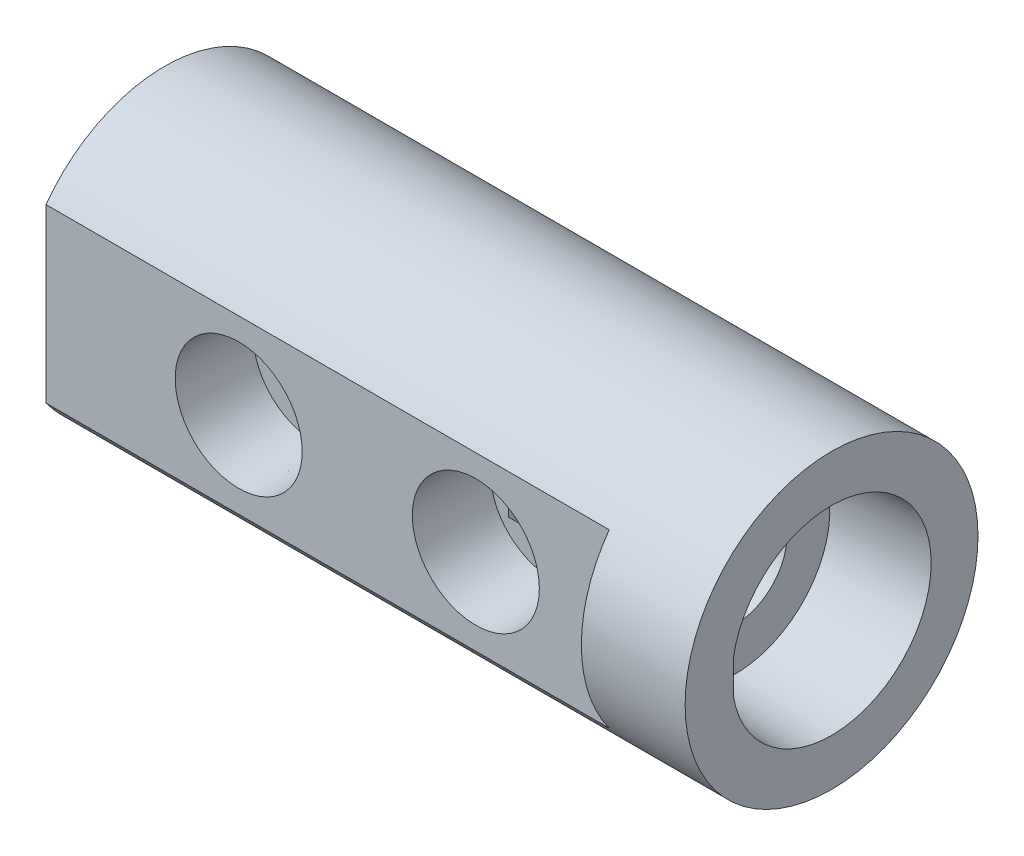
ISO-10303-21;
HEADER;
FILE_DESCRIPTION(('STEP AP214'),'2;1');
FILE_NAME('part.step','',(''),(''),'','','');
FILE_SCHEMA(('AUTOMOTIVE_DESIGN { 1 0 10303 214 1 1 1 1 }'));
ENDSEC;
DATA;
#1=APPLICATION_CONTEXT('core data for automotive mechanical design processes');
#2=APPLICATION_PROTOCOL_DEFINITION('international standard','automotive_design',2000,#1);
#3=PRODUCT_CONTEXT('',#1,'mechanical');
#4=PRODUCT('Part','Part','',(#3));
#5=PRODUCT_RELATED_PRODUCT_CATEGORY('part','',(#4));
#6=PRODUCT_DEFINITION_FORMATION('','',#4);
#7=PRODUCT_DEFINITION_CONTEXT('part definition',#1,'design');
#8=PRODUCT_DEFINITION('design','',#6,#7);
#9=PRODUCT_DEFINITION_SHAPE('','',#8);
#10=(LENGTH_UNIT() NAMED_UNIT(*) SI_UNIT(.MILLI.,.METRE.));
#11=(NAMED_UNIT(*) PLANE_ANGLE_UNIT() SI_UNIT($,.RADIAN.));
#12=(NAMED_UNIT(*) SI_UNIT($,.STERADIAN.) SOLID_ANGLE_UNIT());
#13=UNCERTAINTY_MEASURE_WITH_UNIT(LENGTH_MEASURE(1.E-05),#10,'distance_accuracy_value','');
#14=(GEOMETRIC_REPRESENTATION_CONTEXT(3) GLOBAL_UNCERTAINTY_ASSIGNED_CONTEXT((#13)) GLOBAL_UNIT_ASSIGNED_CONTEXT((#10,
#11,#12)) REPRESENTATION_CONTEXT('',''));
#15=CARTESIAN_POINT('',(0.,0.,0.));
#16=DIRECTION('',(0.,0.,1.));
#17=DIRECTION('',(1.,0.,0.));
#18=AXIS2_PLACEMENT_3D('',#15,#16,#17);
#19=CARTESIAN_POINT('',(71.4375,0.,0.));
#20=DIRECTION('',(1.,0.,0.));
#21=DIRECTION('',(0.,0.,-1.));
#22=AXIS2_PLACEMENT_3D('',#19,#20,#21);
#23=CONICAL_SURFACE('',#22,10.668,0.0523598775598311);
#24=CARTESIAN_POINT('',(61.1251,0.,0.));
#25=DIRECTION('',(-1.,0.,0.));
#26=DIRECTION('',(0.,0.,1.));
#27=AXIS2_PLACEMENT_3D('',#24,#25,#26);
#28=CIRCLE('',#27,10.1275500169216);
#29=CARTESIAN_POINT('',(61.1251,0.,10.1275500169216));
#30=VERTEX_POINT('',#29);
#31=EDGE_CURVE('E278',#30,#30,#28,.T.);
#32=ORIENTED_EDGE('',*,*,#31,.T.);
#33=EDGE_LOOP('',(#32));
#34=FACE_BOUND('',#33,.T.);
#35=CARTESIAN_POINT('',(71.4375,0.,0.));
#36=DIRECTION('',(-1.,0.,0.));
#37=DIRECTION('',(0.,0.,1.));
#38=AXIS2_PLACEMENT_3D('',#35,#36,#37);
#39=CIRCLE('',#38,10.668);
#40=CARTESIAN_POINT('',(71.4375,1.71412147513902,10.5293879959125));
#41=VERTEX_POINT('',#40);
#42=CARTESIAN_POINT('',(71.4375,-1.71412147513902,10.5293879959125));
#43=VERTEX_POINT('',#42);
#44=EDGE_CURVE('E275',#41,#43,#39,.T.);
#45=ORIENTED_EDGE('',*,*,#44,.F.);
#46=CARTESIAN_POINT('',(81.2784541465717,-3.76936147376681,10.5293879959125));
#47=CARTESIAN_POINT('',(80.9499446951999,-3.71827289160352,10.5293879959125));
#48=CARTESIAN_POINT('',(80.6215719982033,-3.66630009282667,10.5293879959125));
#49=CARTESIAN_POINT('',(79.9651469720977,-3.5603155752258,10.5293879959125));
#50=CARTESIAN_POINT('',(79.6370946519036,-3.50630380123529,10.5293879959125));
#51=CARTESIAN_POINT('',(78.6528095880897,-3.3406897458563,10.5293879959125));
#52=CARTESIAN_POINT('',(77.9971560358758,-3.22561752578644,10.5293879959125));
#53=CARTESIAN_POINT('',(76.6789674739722,-2.98137393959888,10.5293879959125));
#54=CARTESIAN_POINT('',(76.0164641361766,-2.85202821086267,10.5293879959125));
#55=CARTESIAN_POINT('',(75.0258509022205,-2.64393859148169,10.5293879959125));
#56=CARTESIAN_POINT('',(74.6962614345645,-2.57225212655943,10.5293879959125));
#57=CARTESIAN_POINT('',(74.0384474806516,-2.42289412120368,10.5293879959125));
#58=CARTESIAN_POINT('',(73.7102229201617,-2.34522291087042,10.5293879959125));
#59=CARTESIAN_POINT('',(73.1066490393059,-2.19471862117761,10.5293879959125));
#60=CARTESIAN_POINT('',(72.8310199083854,-2.12301357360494,10.5293879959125));
#61=CARTESIAN_POINT('',(72.2815691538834,-1.97218140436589,10.5293879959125));
#62=CARTESIAN_POINT('',(72.0077489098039,-1.89304919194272,10.5293879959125));
#63=CARTESIAN_POINT('',(71.4631875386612,-1.7244837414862,10.5293879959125));
#64=CARTESIAN_POINT('',(71.1924471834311,-1.63504798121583,10.5293879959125));
#65=CARTESIAN_POINT('',(70.6567247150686,-1.44092895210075,10.5293879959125));
#66=CARTESIAN_POINT('',(70.3917348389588,-1.33626792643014,10.5293879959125));
#67=CARTESIAN_POINT('',(69.9671290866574,-1.14265612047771,10.5293879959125));
#68=CARTESIAN_POINT('',(69.8040268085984,-1.06168730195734,10.5293879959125));
#69=CARTESIAN_POINT('',(69.5674849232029,-0.926697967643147,10.5293879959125));
#70=CARTESIAN_POINT('',(69.4901542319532,-0.87956644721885,10.5293879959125));
#71=CARTESIAN_POINT('',(69.3396473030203,-0.779148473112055,10.5293879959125));
#72=CARTESIAN_POINT('',(69.2664641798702,-0.725872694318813,10.5293879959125));
#73=CARTESIAN_POINT('',(69.1503126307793,-0.629742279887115,10.5293879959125));
#74=CARTESIAN_POINT('',(69.1053740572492,-0.589292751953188,10.5293879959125));
#75=CARTESIAN_POINT('',(69.0204360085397,-0.503397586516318,10.5293879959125));
#76=CARTESIAN_POINT('',(68.9804319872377,-0.45795662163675,10.5293879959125));
#77=CARTESIAN_POINT('',(68.919940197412,-0.376355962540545,10.5293879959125));
#78=CARTESIAN_POINT('',(68.8972868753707,-0.341824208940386,10.5293879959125));
#79=CARTESIAN_POINT('',(68.8573778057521,-0.269750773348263,10.5293879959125));
#80=CARTESIAN_POINT('',(68.8401117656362,-0.232215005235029,10.5293879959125));
#81=CARTESIAN_POINT('',(68.8157483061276,-0.162671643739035,10.5293879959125));
#82=CARTESIAN_POINT('',(68.8072786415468,-0.131152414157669,10.5293879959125));
#83=CARTESIAN_POINT('',(68.7957856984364,-0.0671414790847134,10.5293879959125));
#84=CARTESIAN_POINT('',(68.7927559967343,-0.0346509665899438,10.5293879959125));
#85=CARTESIAN_POINT('',(68.792502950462,0.030411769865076,10.5293879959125));
#86=CARTESIAN_POINT('',(68.7952899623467,0.0629840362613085,10.5293879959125));
#87=CARTESIAN_POINT('',(68.8063456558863,0.127191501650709,10.5293879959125));
#88=CARTESIAN_POINT('',(68.8146210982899,0.158825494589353,10.5293879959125));
#89=CARTESIAN_POINT('',(68.8393674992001,0.23084783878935,10.5293879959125));
#90=CARTESIAN_POINT('',(68.8576587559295,0.270602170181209,10.5293879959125));
#91=CARTESIAN_POINT('',(68.9002140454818,0.346737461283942,10.5293879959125));
#92=CARTESIAN_POINT('',(68.9244908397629,0.383110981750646,10.5293879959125));
#93=CARTESIAN_POINT('',(68.9987662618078,0.481315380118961,10.5293879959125));
#94=CARTESIAN_POINT('',(69.0535074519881,0.539501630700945,10.5293879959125));
#95=CARTESIAN_POINT('',(69.1702005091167,0.648091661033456,10.5293879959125));
#96=CARTESIAN_POINT('',(69.2321794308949,0.6984644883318,10.5293879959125));
#97=CARTESIAN_POINT('',(69.4055088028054,0.827066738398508,10.5293879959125));
#98=CARTESIAN_POINT('',(69.5208353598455,0.899869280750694,10.5293879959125));
#99=CARTESIAN_POINT('',(69.7574111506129,1.03527927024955,10.5293879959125));
#100=CARTESIAN_POINT('',(69.8786752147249,1.09785929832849,10.5293879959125));
#101=CARTESIAN_POINT('',(70.1259453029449,1.21651345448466,10.5293879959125));
#102=CARTESIAN_POINT('',(70.2519884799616,1.272509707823,10.5293879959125));
#103=CARTESIAN_POINT('',(70.5060956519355,1.37909440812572,10.5293879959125));
#104=CARTESIAN_POINT('',(70.6341565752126,1.42969030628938,10.5293879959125));
#105=CARTESIAN_POINT('',(70.9244693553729,1.53913017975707,10.5293879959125));
#106=CARTESIAN_POINT('',(71.0871571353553,1.5968125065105,10.5293879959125));
#107=CARTESIAN_POINT('',(71.4141688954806,1.70736204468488,10.5293879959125));
#108=CARTESIAN_POINT('',(71.5784931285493,1.76022849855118,10.5293879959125));
#109=CARTESIAN_POINT('',(72.0733709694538,1.91325202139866,10.5293879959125));
#110=CARTESIAN_POINT('',(72.4056630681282,2.007773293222,10.5293879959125));
#111=CARTESIAN_POINT('',(73.0739409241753,2.18701804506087,10.5293879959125));
#112=CARTESIAN_POINT('',(73.4099350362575,2.27170961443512,10.5293879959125));
#113=CARTESIAN_POINT('',(74.0836006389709,2.43361445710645,10.5293879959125));
#114=CARTESIAN_POINT('',(74.4212715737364,2.51083005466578,10.5293879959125));
#115=CARTESIAN_POINT('',(75.0634022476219,2.65196072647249,10.5293879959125));
#116=CARTESIAN_POINT('',(75.3677413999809,2.71642944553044,10.5293879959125));
#117=CARTESIAN_POINT('',(75.9772232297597,2.8415963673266,10.5293879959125));
#118=CARTESIAN_POINT('',(76.2823659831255,2.90229419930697,10.5293879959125));
#119=CARTESIAN_POINT('',(76.8914092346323,3.02018641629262,10.5293879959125));
#120=CARTESIAN_POINT('',(77.195306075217,3.07739978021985,10.5293879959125));
#121=CARTESIAN_POINT('',(77.8035459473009,3.18915235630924,10.5293879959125));
#122=CARTESIAN_POINT('',(78.1078889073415,3.24369195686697,10.5293879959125));
#123=CARTESIAN_POINT('',(78.4124228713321,3.2971196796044,10.5293879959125));
#124=B_SPLINE_CURVE_WITH_KNOTS('',3,(#46,#47,#48,#49,#50,#51,#52,#53,#54,#55,#56,#57,#58,#59,
#60,#61,#62,#63,#64,#65,#66,#67,#68,#69,#70,#71,#72,#73,#74,#75,#76,#77,#78,#79,#80,#81,#82,#83,
#84,#85,#86,#87,#88,#89,#90,#91,#92,#93,#94,#95,#96,#97,#98,#99,#100,#101,#102,#103,#104,#105,
#106,#107,#108,#109,#110,#111,#112,#113,#114,#115,#116,#117,#118,#119,#120,#121,#122,#123),
.UNSPECIFIED.,.F.,.F.,(4,2,2,2,2,2,2,2,2,2,2,2,2,2,2,2,2,2,2,2,2,2,2,2,2,2,2,2,2,2,2,2,2,2,2,2,
2,2,4),(0.,0.997374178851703,1.99477536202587,3.99172438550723,6.01654421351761,
7.02839092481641,8.04018186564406,8.89452142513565,9.74945090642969,10.6045901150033,
11.4584923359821,12.0039386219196,12.2754446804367,12.5464859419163,12.7276213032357,
12.9085885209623,13.0321540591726,13.1554820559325,13.2529841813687,13.3503711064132,
13.4479315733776,13.545612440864,13.6761463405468,13.8069609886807,14.0452807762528,
14.2845217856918,14.69258954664,15.1017344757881,15.5153143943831,15.9283160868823,
16.44604051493,16.9638462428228,17.9999884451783,19.0394054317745,20.0784982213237,
21.0117493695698,21.9450921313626,22.8727865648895,23.8003458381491),.UNSPECIFIED.);
#125=EDGE_CURVE('E223',#41,#43,#124,.F.);
#126=ORIENTED_EDGE('',*,*,#125,.T.);
#127=EDGE_LOOP('',(#45,#126));
#128=FACE_BOUND('',#127,.T.);
#129=ADVANCED_FACE('F18',(#34,#128),#23,.F.);
#130=CARTESIAN_POINT('',(46.0375,0.,4.5847));
#131=DIRECTION('',(0.,0.,-1.));
#132=DIRECTION('',(-1.,0.,0.));
#133=AXIS2_PLACEMENT_3D('',#130,#131,#132);
#134=CYLINDRICAL_SURFACE('',#133,4.6228);
#135=CARTESIAN_POINT('',(46.0375,0.,4.572));
#136=DIRECTION('',(0.,0.,-1.));
#137=DIRECTION('',(-1.,0.,0.));
#138=AXIS2_PLACEMENT_3D('',#135,#136,#137);
#139=CIRCLE('',#138,4.6228);
#140=CARTESIAN_POINT('',(49.4245449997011,-3.14614144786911,4.572));
#141=VERTEX_POINT('',#140);
#142=CARTESIAN_POINT('',(42.6504550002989,-3.14614144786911,4.572));
#143=VERTEX_POINT('',#142);
#144=EDGE_CURVE('E382',#141,#143,#139,.T.);
#145=ORIENTED_EDGE('',*,*,#144,.F.);
#146=CARTESIAN_POINT('',(49.4416686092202,-3.12760546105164,4.5847));
#147=CARTESIAN_POINT('',(49.3455665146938,-3.2321457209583,4.51340596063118));
#148=CARTESIAN_POINT('',(49.2453586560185,-3.33160311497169,4.44029857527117));
#149=CARTESIAN_POINT('',(49.0369849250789,-3.52040426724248,4.29214408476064));
#150=CARTESIAN_POINT('',(48.9288137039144,-3.60974112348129,4.21709569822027));
#151=CARTESIAN_POINT('',(48.7034873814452,-3.77927279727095,4.06590106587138));
#152=CARTESIAN_POINT('',(48.5862362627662,-3.85933825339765,3.98975290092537));
#153=CARTESIAN_POINT('',(48.3439818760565,-4.00882393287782,3.83952445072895));
#154=CARTESIAN_POINT('',(48.2189823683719,-4.07824926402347,3.7654431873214));
#155=CARTESIAN_POINT('',(47.9242292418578,-4.2243087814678,3.6016324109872));
#156=CARTESIAN_POINT('',(47.7518353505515,-4.29740554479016,3.51342173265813));
#157=CARTESIAN_POINT('',(47.3932505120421,-4.4235859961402,3.35315432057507));
#158=CARTESIAN_POINT('',(47.2071181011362,-4.47674932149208,3.28103378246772));
#159=CARTESIAN_POINT('',(46.869029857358,-4.54981923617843,3.17860223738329));
#160=CARTESIAN_POINT('',(46.7200078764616,-4.57469917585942,3.14236217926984));
#161=CARTESIAN_POINT('',(46.4168134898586,-4.60972542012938,3.09076742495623));
#162=CARTESIAN_POINT('',(46.2626528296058,-4.6199032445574,3.0753680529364));
#163=CARTESIAN_POINT('',(45.9529225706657,-4.62462800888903,3.06826296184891));
#164=CARTESIAN_POINT('',(45.7973498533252,-4.6191160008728,3.07664659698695));
#165=CARTESIAN_POINT('',(45.4902651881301,-4.59289488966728,3.11564015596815));
#166=CARTESIAN_POINT('',(45.3387609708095,-4.57215872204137,3.14628966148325));
#167=CARTESIAN_POINT('',(44.9879139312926,-4.50680845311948,3.23948933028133));
#168=CARTESIAN_POINT('',(44.7917642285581,-4.45617828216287,3.30966840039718));
#169=CARTESIAN_POINT('',(44.5089310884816,-4.36390980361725,3.42932530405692));
#170=CARTESIAN_POINT('',(44.4162610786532,-4.33029289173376,3.47177548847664));
#171=CARTESIAN_POINT('',(44.2346846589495,-4.25789502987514,3.56019352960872));
#172=CARTESIAN_POINT('',(44.1457774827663,-4.21911513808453,3.60616066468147));
#173=CARTESIAN_POINT('',(43.9215223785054,-4.11290448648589,3.72761695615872));
#174=CARTESIAN_POINT('',(43.7888647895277,-4.04182074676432,3.80488387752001));
#175=CARTESIAN_POINT('',(43.5321293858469,-3.88790484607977,3.96203392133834));
#176=CARTESIAN_POINT('',(43.4080567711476,-3.80506565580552,4.04191858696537));
#177=CARTESIAN_POINT('',(43.1705710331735,-3.62938249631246,4.20032292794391));
#178=CARTESIAN_POINT('',(43.0570085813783,-3.53674058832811,4.27884184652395));
#179=CARTESIAN_POINT('',(42.893159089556,-3.3895107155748,4.3950561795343));
#180=CARTESIAN_POINT('',(42.8396434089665,-3.33907628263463,4.43351978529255));
#181=CARTESIAN_POINT('',(42.7348167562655,-3.23542759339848,4.50971558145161));
#182=CARTESIAN_POINT('',(42.6835060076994,-3.1822130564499,4.54744769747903));
#183=CARTESIAN_POINT('',(42.6333313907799,-3.12760546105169,4.5847));
#184=B_SPLINE_CURVE_WITH_KNOTS('',3,(#146,#147,#148,#149,#150,#151,#152,#153,#154,#155,#156,
#157,#158,#159,#160,#161,#162,#163,#164,#165,#166,#167,#168,#169,#170,#171,#172,#173,#174,#175,
#176,#177,#178,#179,#180,#181,#182,#183),.UNSPECIFIED.,.F.,.F.,(4,2,2,2,2,2,2,2,2,2,2,2,2,2,2,2,
2,2,4),(0.,0.476467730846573,0.953258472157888,1.43605630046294,1.91862163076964,
2.53801318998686,3.15490312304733,3.61921096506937,4.0825218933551,4.54757581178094,
5.01345847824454,5.65281681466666,5.97465788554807,6.2964330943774,6.80322233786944,
7.31031590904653,7.80847219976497,8.05736770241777,8.30628837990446),.UNSPECIFIED.);
#185=EDGE_CURVE('E268',#141,#143,#184,.T.);
#186=ORIENTED_EDGE('',*,*,#185,.T.);
#187=EDGE_LOOP('',(#145,#186));
#188=FACE_BOUND('',#187,.T.);
#189=ADVANCED_FACE('F242',(#188),#134,.F.);
#190=CARTESIAN_POINT('',(46.0375,0.,4.572));
#191=DIRECTION('',(0.,0.,-1.));
#192=DIRECTION('',(-1.,0.,0.));
#193=AXIS2_PLACEMENT_3D('',#190,#191,#192);
#194=CIRCLE('',#193,4.6228);
#195=CARTESIAN_POINT('',(42.6504550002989,3.14614144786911,4.572));
#196=VERTEX_POINT('',#195);
#197=CARTESIAN_POINT('',(49.4245449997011,3.14614144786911,4.572));
#198=VERTEX_POINT('',#197);
#199=EDGE_CURVE('E12',#196,#198,#194,.T.);
#200=ORIENTED_EDGE('',*,*,#199,.F.);
#201=CARTESIAN_POINT('',(42.6333313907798,3.12760546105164,4.5847));
#202=CARTESIAN_POINT('',(42.7294334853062,3.23214572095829,4.51340596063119));
#203=CARTESIAN_POINT('',(42.8296413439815,3.33160311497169,4.44029857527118));
#204=CARTESIAN_POINT('',(43.0380150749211,3.52040426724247,4.29214408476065));
#205=CARTESIAN_POINT('',(43.1461862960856,3.60974112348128,4.21709569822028));
#206=CARTESIAN_POINT('',(43.3715126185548,3.77927279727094,4.06590106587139));
#207=CARTESIAN_POINT('',(43.4887637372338,3.85933825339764,3.98975290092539));
#208=CARTESIAN_POINT('',(43.7310181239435,4.00882393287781,3.83952445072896));
#209=CARTESIAN_POINT('',(43.8560176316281,4.07824926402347,3.7654431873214));
#210=CARTESIAN_POINT('',(44.1507707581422,4.2243087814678,3.6016324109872));
#211=CARTESIAN_POINT('',(44.3231646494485,4.29740554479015,3.51342173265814));
#212=CARTESIAN_POINT('',(44.6817494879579,4.42358599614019,3.35315432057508));
#213=CARTESIAN_POINT('',(44.8678818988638,4.47674932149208,3.28103378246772));
#214=CARTESIAN_POINT('',(45.205970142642,4.54981923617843,3.17860223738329));
#215=CARTESIAN_POINT('',(45.3549921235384,4.57469917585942,3.14236217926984));
#216=CARTESIAN_POINT('',(45.6581865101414,4.60972542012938,3.09076742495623));
#217=CARTESIAN_POINT('',(45.8123471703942,4.61990324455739,3.0753680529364));
#218=CARTESIAN_POINT('',(46.1220774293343,4.62462800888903,3.06826296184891));
#219=CARTESIAN_POINT('',(46.2776501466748,4.6191160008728,3.07664659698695));
#220=CARTESIAN_POINT('',(46.5847348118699,4.59289488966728,3.11564015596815));
#221=CARTESIAN_POINT('',(46.7362390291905,4.57215872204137,3.14628966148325));
#222=CARTESIAN_POINT('',(47.0870860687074,4.50680845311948,3.23948933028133));
#223=CARTESIAN_POINT('',(47.2832357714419,4.45617828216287,3.30966840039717));
#224=CARTESIAN_POINT('',(47.5660689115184,4.36390980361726,3.42932530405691));
#225=CARTESIAN_POINT('',(47.6587389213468,4.33029289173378,3.47177548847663));
#226=CARTESIAN_POINT('',(47.8403153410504,4.25789502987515,3.56019352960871));
#227=CARTESIAN_POINT('',(47.9292225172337,4.21911513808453,3.60616066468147));
#228=CARTESIAN_POINT('',(48.1534776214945,4.11290448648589,3.72761695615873));
#229=CARTESIAN_POINT('',(48.2861352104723,4.04182074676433,3.80488387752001));
#230=CARTESIAN_POINT('',(48.5428706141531,3.88790484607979,3.96203392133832));
#231=CARTESIAN_POINT('',(48.6669432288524,3.80506565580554,4.04191858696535));
#232=CARTESIAN_POINT('',(48.9044289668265,3.62938249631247,4.2003229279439));
#233=CARTESIAN_POINT('',(49.0179914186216,3.53674058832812,4.27884184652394));
#234=CARTESIAN_POINT('',(49.181840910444,3.38951071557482,4.39505617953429));
#235=CARTESIAN_POINT('',(49.2353565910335,3.33907628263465,4.43351978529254));
#236=CARTESIAN_POINT('',(49.3401832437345,3.23542759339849,4.5097155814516));
#237=CARTESIAN_POINT('',(49.3914939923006,3.18221305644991,4.54744769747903));
#238=CARTESIAN_POINT('',(49.4416686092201,3.12760546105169,4.5847));
#239=B_SPLINE_CURVE_WITH_KNOTS('',3,(#201,#202,#203,#204,#205,#206,#207,#208,#209,#210,#211,
#212,#213,#214,#215,#216,#217,#218,#219,#220,#221,#222,#223,#224,#225,#226,#227,#228,#229,#230,
#231,#232,#233,#234,#235,#236,#237,#238),.UNSPECIFIED.,.F.,.F.,(4,2,2,2,2,2,2,2,2,2,2,2,2,2,2,2,
2,2,4),(0.,0.476467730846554,0.95325847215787,1.43605630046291,1.9186216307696,2.53801318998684,
3.15490312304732,3.61921096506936,4.08252189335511,4.54757581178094,5.01345847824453,
5.65281681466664,5.97465788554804,6.29643309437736,6.8032223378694,7.3103159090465,
7.80847219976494,8.05736770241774,8.30628837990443),.UNSPECIFIED.);
#240=EDGE_CURVE('E263',#196,#198,#239,.T.);
#241=ORIENTED_EDGE('',*,*,#240,.T.);
#242=EDGE_LOOP('',(#200,#241));
#243=FACE_BOUND('',#242,.T.);
#244=ADVANCED_FACE('F253',(#243),#134,.F.);
#245=CARTESIAN_POINT('',(61.1251,0.,-10.1275500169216));
#246=DIRECTION('',(1.,0.,0.));
#247=DIRECTION('',(0.,0.,-1.));
#248=AXIS2_PLACEMENT_3D('',#245,#246,#247);
#249=PLANE('',#248);
#250=ORIENTED_EDGE('',*,*,#31,.F.);
#251=EDGE_LOOP('',(#250));
#252=FACE_BOUND('',#251,.T.);
#253=CARTESIAN_POINT('',(61.1251,0.,0.));
#254=DIRECTION('',(1.,0.,0.));
#255=DIRECTION('',(0.,0.,-1.));
#256=AXIS2_PLACEMENT_3D('',#253,#254,#255);
#257=CIRCLE('',#256,5.5499);
#258=CARTESIAN_POINT('',(61.1251,0.,-5.5499));
#259=VERTEX_POINT('',#258);
#260=EDGE_CURVE('E337',#259,#259,#257,.F.);
#261=ORIENTED_EDGE('',*,*,#260,.T.);
#262=EDGE_LOOP('',(#261));
#263=FACE_BOUND('',#262,.T.);
#264=ADVANCED_FACE('F244',(#252,#263),#249,.T.);
#265=CARTESIAN_POINT('',(71.4375,0.,0.));
#266=DIRECTION('',(-1.,0.,0.));
#267=DIRECTION('',(0.,-1.,0.));
#268=AXIS2_PLACEMENT_3D('',#265,#266,#267);
#269=PLANE('',#268);
#270=ORIENTED_EDGE('',*,*,#44,.T.);
#271=DIRECTION('',(0.,-1.,0.));
#272=VECTOR('',#271,1.);
#273=CARTESIAN_POINT('',(71.4375,-6.75422672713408,10.5293879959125));
#274=LINE('',#273,#272);
#275=EDGE_CURVE('E234',#41,#43,#274,.T.);
#276=ORIENTED_EDGE('',*,*,#275,.F.);
#277=EDGE_LOOP('',(#270,#276));
#278=FACE_BOUND('',#277,.T.);
#279=CARTESIAN_POINT('',(71.4375,0.,0.));
#280=DIRECTION('',(-1.,0.,0.));
#281=DIRECTION('',(0.,-1.,0.));
#282=AXIS2_PLACEMENT_3D('',#279,#280,#281);
#283=CIRCLE('',#282,15.6845);
#284=CARTESIAN_POINT('',(71.4375,-15.6845,0.));
#285=VERTEX_POINT('',#284);
#286=EDGE_CURVE('E233',#285,#285,#283,.F.);
#287=ORIENTED_EDGE('',*,*,#286,.T.);
#288=EDGE_LOOP('',(#287));
#289=FACE_BOUND('',#288,.T.);
#290=ADVANCED_FACE('F404',(#278,#289),#269,.F.);
#291=CARTESIAN_POINT('',(46.6400387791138,0.,0.));
#292=DIRECTION('',(-1.,0.,0.));
#293=DIRECTION('',(0.,0.,1.));
#294=AXIS2_PLACEMENT_3D('',#291,#292,#293);
#295=CYLINDRICAL_SURFACE('',#294,5.5499);
#296=DIRECTION('',(-1.,0.,0.));
#297=VECTOR('',#296,1.);
#298=CARTESIAN_POINT('',(46.6400387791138,-3.14614144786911,4.572));
#299=LINE('',#298,#297);
#300=CARTESIAN_POINT('',(41.4147,-3.14614144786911,4.572));
#301=VERTEX_POINT('',#300);
#302=EDGE_CURVE('E27',#143,#301,#299,.T.);
#303=ORIENTED_EDGE('',*,*,#302,.F.);
#304=ORIENTED_EDGE('',*,*,#185,.F.);
#305=CARTESIAN_POINT('',(51.7915353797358,-3.14614144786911,4.572));
#306=VERTEX_POINT('',#305);
#307=EDGE_CURVE('E145',#306,#141,#299,.T.);
#308=ORIENTED_EDGE('',*,*,#307,.F.);
#309=CARTESIAN_POINT('',(51.7913696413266,3.14643206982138,4.5718));
#310=CARTESIAN_POINT('',(51.8496356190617,3.04428221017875,4.6421047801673));
#311=CARTESIAN_POINT('',(51.9059175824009,2.93896301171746,4.70953962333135));
#312=CARTESIAN_POINT('',(52.0138233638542,2.72211587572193,4.83811694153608));
#313=CARTESIAN_POINT('',(52.0654425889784,2.61058198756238,4.89925322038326));
#314=CARTESIAN_POINT('',(52.163561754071,2.3808265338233,5.01494880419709));
#315=CARTESIAN_POINT('',(52.2100229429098,2.26256328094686,5.06945858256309));
#316=CARTESIAN_POINT('',(52.2966126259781,2.02053898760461,5.17068765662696));
#317=CARTESIAN_POINT('',(52.3367429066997,1.89677951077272,5.21740915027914));
#318=CARTESIAN_POINT('',(52.4101618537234,1.64353556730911,5.30265405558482));
#319=CARTESIAN_POINT('',(52.4434054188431,1.51401971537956,5.34112347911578));
#320=CARTESIAN_POINT('',(52.5020115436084,1.25085377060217,5.40880836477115));
#321=CARTESIAN_POINT('',(52.5273751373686,1.11720422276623,5.43802504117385));
#322=CARTESIAN_POINT('',(52.5695567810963,0.847267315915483,5.48655329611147));
#323=CARTESIAN_POINT('',(52.5864038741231,0.710990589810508,5.50589854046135));
#324=CARTESIAN_POINT('',(52.6112565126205,0.436584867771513,5.53441987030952));
#325=CARTESIAN_POINT('',(52.6192633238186,0.298456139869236,5.54359741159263));
#326=CARTESIAN_POINT('',(52.6258538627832,0.0366861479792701,5.55115193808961));
#327=CARTESIAN_POINT('',(52.6253647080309,-0.0869029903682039,5.55059156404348));
#328=CARTESIAN_POINT('',(52.6172099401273,-0.333528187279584,5.54124316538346));
#329=CARTESIAN_POINT('',(52.6095445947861,-0.456564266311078,5.53245544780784));
#330=CARTESIAN_POINT('',(52.587184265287,-0.701249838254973,5.50679391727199));
#331=CARTESIAN_POINT('',(52.5724833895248,-0.822898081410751,5.48991332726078));
#332=CARTESIAN_POINT('',(52.536356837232,-1.06381085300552,5.44836301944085));
#333=CARTESIAN_POINT('',(52.5149311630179,-1.18307538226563,5.42369330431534));
#334=CARTESIAN_POINT('',(52.4427418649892,-1.5284820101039,5.34039958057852));
#335=CARTESIAN_POINT('',(52.3832630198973,-1.75045429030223,5.27157805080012));
#336=CARTESIAN_POINT('',(52.2442407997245,-2.17844591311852,5.10962145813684));
#337=CARTESIAN_POINT('',(52.1646967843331,-2.38446474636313,5.01648561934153));
#338=CARTESIAN_POINT('',(52.033194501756,-2.68032122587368,4.86104865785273));
#339=CARTESIAN_POINT('',(51.9871779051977,-2.77700604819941,4.80643250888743));
#340=CARTESIAN_POINT('',(51.8917339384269,-2.96538861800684,4.69253921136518));
#341=CARTESIAN_POINT('',(51.8423169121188,-3.05710009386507,4.63327612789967));
#342=CARTESIAN_POINT('',(51.7913696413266,-3.14643206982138,4.5718));
#343=B_SPLINE_CURVE_WITH_KNOTS('',3,(#309,#310,#311,#312,#313,#314,#315,#316,#317,#318,#319,
#320,#321,#322,#323,#324,#325,#326,#327,#328,#329,#330,#331,#332,#333,#334,#335,#336,#337,#338,
#339,#340,#341,#342),.UNSPECIFIED.,.F.,.F.,(4,2,2,2,2,2,2,2,2,2,2,2,2,2,2,2,4),(0.,
0.411024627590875,0.822449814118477,1.2367822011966,1.65099745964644,2.06784516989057,
2.48463815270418,2.90000002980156,3.31530242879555,3.68560010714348,4.05588396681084,
4.42647844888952,4.79707280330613,5.5136498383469,6.23024974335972,6.59064800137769,
6.94999467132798),.UNSPECIFIED.);
#344=CARTESIAN_POINT('',(51.7915353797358,3.14614144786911,4.572));
#345=VERTEX_POINT('',#344);
#346=EDGE_CURVE('E151',#345,#306,#343,.T.);
#347=ORIENTED_EDGE('',*,*,#346,.F.);
#348=DIRECTION('',(-1.,0.,0.));
#349=VECTOR('',#348,1.);
#350=CARTESIAN_POINT('',(46.6400387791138,3.14614144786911,4.572));
#351=LINE('',#350,#349);
#352=EDGE_CURVE('E135',#198,#345,#351,.F.);
#353=ORIENTED_EDGE('',*,*,#352,.F.);
#354=ORIENTED_EDGE('',*,*,#240,.F.);
#355=CARTESIAN_POINT('',(41.4147,3.14614144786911,4.572));
#356=VERTEX_POINT('',#355);
#357=EDGE_CURVE('E148',#356,#196,#351,.F.);
#358=ORIENTED_EDGE('',*,*,#357,.F.);
#359=CARTESIAN_POINT('',(41.4147,0.,0.));
#360=DIRECTION('',(-1.,0.,0.));
#361=DIRECTION('',(0.,0.,1.));
#362=AXIS2_PLACEMENT_3D('',#359,#360,#361);
#363=CIRCLE('',#362,5.5499);
#364=CARTESIAN_POINT('',(41.4147,0.,-5.5499));
#365=VERTEX_POINT('',#364);
#366=EDGE_CURVE('E232',#356,#365,#363,.T.);
#367=ORIENTED_EDGE('',*,*,#366,.T.);
#368=CARTESIAN_POINT('',(41.4147,0.,-5.5499));
#369=CARTESIAN_POINT('',(41.4146943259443,-0.109852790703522,-5.54990556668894));
#370=CARTESIAN_POINT('',(41.4186188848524,-0.219662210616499,-5.54663469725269));
#371=CARTESIAN_POINT('',(41.4342281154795,-0.438375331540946,-5.53364267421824));
#372=CARTESIAN_POINT('',(41.4459137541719,-0.547278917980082,-5.52392071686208));
#373=CARTESIAN_POINT('',(41.4768456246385,-0.763297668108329,-5.49823647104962));
#374=CARTESIAN_POINT('',(41.4960948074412,-0.870412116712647,-5.48227174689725));
#375=CARTESIAN_POINT('',(41.5418141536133,-1.08204913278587,-5.44445947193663));
#376=CARTESIAN_POINT('',(41.568287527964,-1.18657052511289,-5.42260930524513));
#377=CARTESIAN_POINT('',(41.6575555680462,-1.49384226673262,-5.34919260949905));
#378=CARTESIAN_POINT('',(41.7304291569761,-1.69185444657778,-5.28956549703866));
#379=CARTESIAN_POINT('',(41.8993629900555,-2.07106779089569,-5.15294264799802));
#380=CARTESIAN_POINT('',(41.9954309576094,-2.25226332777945,-5.07594112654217));
#381=CARTESIAN_POINT('',(42.1736972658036,-2.54172950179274,-4.93539331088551));
#382=CARTESIAN_POINT('',(42.2506953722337,-2.65495975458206,-4.87527676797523));
#383=CARTESIAN_POINT('',(42.4129685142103,-2.87253663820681,-4.75033197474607));
#384=CARTESIAN_POINT('',(42.4982434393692,-2.97688338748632,-4.68550378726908));
#385=CARTESIAN_POINT('',(42.676563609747,-3.1768518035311,-4.55230457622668));
#386=CARTESIAN_POINT('',(42.7696291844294,-3.27244918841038,-4.48392447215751));
#387=CARTESIAN_POINT('',(42.9628066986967,-3.45458580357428,-4.34515023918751));
#388=CARTESIAN_POINT('',(43.0629177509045,-3.54112617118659,-4.27475636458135));
#389=CARTESIAN_POINT('',(43.2718147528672,-3.70666345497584,-4.13209259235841));
#390=CARTESIAN_POINT('',(43.3807262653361,-3.78549262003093,-4.05981198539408));
#391=CARTESIAN_POINT('',(43.6055625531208,-3.93371316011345,-3.91636643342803));
#392=CARTESIAN_POINT('',(43.7214896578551,-4.00310137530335,-3.84520186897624));
#393=CARTESIAN_POINT('',(43.9602349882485,-4.13202315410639,-3.70630851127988));
#394=CARTESIAN_POINT('',(44.0830360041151,-4.19157997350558,-3.63857188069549));
#395=CARTESIAN_POINT('',(44.3360442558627,-4.30049693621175,-3.50916830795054));
#396=CARTESIAN_POINT('',(44.4662450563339,-4.34986577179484,-3.44749621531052));
#397=CARTESIAN_POINT('',(44.747131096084,-4.4417443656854,-3.32843133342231));
#398=CARTESIAN_POINT('',(44.89859017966,-4.4831681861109,-3.27199061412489));
#399=CARTESIAN_POINT('',(45.210232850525,-4.55094872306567,-3.17706290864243));
#400=CARTESIAN_POINT('',(45.370394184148,-4.57734205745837,-3.13853233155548));
#401=CARTESIAN_POINT('',(45.6159479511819,-4.60429263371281,-3.09872902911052));
#402=CARTESIAN_POINT('',(45.6992471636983,-4.61117213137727,-3.08845324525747));
#403=CARTESIAN_POINT('',(45.8666684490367,-4.62040153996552,-3.07463101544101));
#404=CARTESIAN_POINT('',(45.950790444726,-4.62275187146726,-3.07108394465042));
#405=CARTESIAN_POINT('',(46.1190247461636,-4.6228466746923,-3.07094076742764));
#406=CARTESIAN_POINT('',(46.2031370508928,-4.62059198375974,-3.07434339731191));
#407=CARTESIAN_POINT('',(46.3706019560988,-4.611546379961,-3.08789493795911));
#408=CARTESIAN_POINT('',(46.4539541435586,-4.60475313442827,-3.09804731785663));
#409=CARTESIAN_POINT('',(46.6260789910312,-4.58606162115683,-3.12565620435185));
#410=CARTESIAN_POINT('',(46.7147233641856,-4.57378456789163,-3.143651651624));
#411=CARTESIAN_POINT('',(46.8897115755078,-4.54443609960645,-3.18593063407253));
#412=CARTESIAN_POINT('',(46.9760537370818,-4.52736128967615,-3.21021862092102));
#413=CARTESIAN_POINT('',(47.2314711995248,-4.46936683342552,-3.29097436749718));
#414=CARTESIAN_POINT('',(47.3965837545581,-4.42171779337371,-3.35526930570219));
#415=CARTESIAN_POINT('',(47.6825462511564,-4.3222804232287,-3.48200967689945));
#416=CARTESIAN_POINT('',(47.8055171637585,-4.27335721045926,-3.54211764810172));
#417=CARTESIAN_POINT('',(48.0447903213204,-4.16632126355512,-3.66741682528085));
#418=CARTESIAN_POINT('',(48.1610886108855,-4.1082031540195,-3.73261099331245));
#419=CARTESIAN_POINT('',(48.387346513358,-3.98311920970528,-3.86581400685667));
#420=CARTESIAN_POINT('',(48.4972973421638,-3.91614151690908,-3.9338265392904));
#421=CARTESIAN_POINT('',(48.7108337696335,-3.77359738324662,-4.07076437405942));
#422=CARTESIAN_POINT('',(48.8144206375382,-3.69803266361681,-4.1396894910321));
#423=CARTESIAN_POINT('',(49.0204222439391,-3.53421274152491,-4.28053713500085));
#424=CARTESIAN_POINT('',(49.1224963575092,-3.44550213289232,-4.35242930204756));
#425=CARTESIAN_POINT('',(49.3192736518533,-3.25862786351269,-4.49405028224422));
#426=CARTESIAN_POINT('',(49.4139757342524,-3.16046279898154,-4.56377877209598));
#427=CARTESIAN_POINT('',(49.5952486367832,-2.9548991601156,-4.69947704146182));
#428=CARTESIAN_POINT('',(49.6818359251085,-2.8475201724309,-4.76545432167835));
#429=CARTESIAN_POINT('',(49.8462765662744,-2.62351570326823,-4.8923573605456));
#430=CARTESIAN_POINT('',(49.9241296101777,-2.5068898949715,-4.95328294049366));
#431=CARTESIAN_POINT('',(50.1072710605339,-2.20287588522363,-5.09799659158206));
#432=CARTESIAN_POINT('',(50.2064101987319,-2.00963302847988,-5.17767961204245));
#433=CARTESIAN_POINT('',(50.3352520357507,-1.70637543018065,-5.28215541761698));
#434=CARTESIAN_POINT('',(50.3748962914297,-1.60302725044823,-5.31447934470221));
#435=CARTESIAN_POINT('',(50.4470424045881,-1.39233296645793,-5.37352221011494));
#436=CARTESIAN_POINT('',(50.4795478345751,-1.28498889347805,-5.40024395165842));
#437=CARTESIAN_POINT('',(50.5371391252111,-1.0660437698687,-5.44771467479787));
#438=CARTESIAN_POINT('',(50.5621616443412,-0.954414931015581,-5.46841262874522));
#439=CARTESIAN_POINT('',(50.6039576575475,-0.728638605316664,-5.50304538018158));
#440=CARTESIAN_POINT('',(50.6207352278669,-0.614492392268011,-5.5169835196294));
#441=CARTESIAN_POINT('',(50.6457188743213,-0.384652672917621,-5.53775615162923));
#442=CARTESIAN_POINT('',(50.6539272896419,-0.268959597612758,-5.54459258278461));
#443=CARTESIAN_POINT('',(50.6616059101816,-0.0370886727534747,-5.55098737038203));
#444=CARTESIAN_POINT('',(50.6610770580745,0.0790891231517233,-5.55054651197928));
#445=CARTESIAN_POINT('',(50.6518832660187,0.296941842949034,-5.54289079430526));
#446=CARTESIAN_POINT('',(50.644199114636,0.398689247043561,-5.53649253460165));
#447=CARTESIAN_POINT('',(50.6221962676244,0.600995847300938,-5.51819831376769));
#448=CARTESIAN_POINT('',(50.60787551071,0.701554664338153,-5.50630064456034));
#449=CARTESIAN_POINT('',(50.5728242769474,0.900740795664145,-5.47724201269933));
#450=CARTESIAN_POINT('',(50.552095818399,0.999368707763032,-5.46008270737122));
#451=CARTESIAN_POINT('',(50.504529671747,1.19414968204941,-5.42081969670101));
#452=CARTESIAN_POINT('',(50.4776896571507,1.29030178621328,-5.39871410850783));
#453=CARTESIAN_POINT('',(50.3877028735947,1.57682563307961,-5.32486367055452));
#454=CARTESIAN_POINT('',(50.3155617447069,1.76263581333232,-5.26598108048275));
#455=CARTESIAN_POINT('',(50.1507775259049,2.11892890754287,-5.13300999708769));
#456=CARTESIAN_POINT('',(50.058126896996,2.28940615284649,-5.05891591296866));
#457=CARTESIAN_POINT('',(49.8832044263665,2.56906098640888,-4.92122980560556));
#458=CARTESIAN_POINT('',(49.8050677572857,2.68221751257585,-4.86034013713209));
#459=CARTESIAN_POINT('',(49.6404924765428,2.89953500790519,-4.73390807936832));
#460=CARTESIAN_POINT('',(49.5540535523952,3.00369563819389,-4.66836551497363));
#461=CARTESIAN_POINT('',(49.3733412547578,3.20322025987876,-4.53379484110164));
#462=CARTESIAN_POINT('',(49.2790449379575,3.29855664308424,-4.46475677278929));
#463=CARTESIAN_POINT('',(49.0833603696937,3.48006075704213,-4.32477712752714));
#464=CARTESIAN_POINT('',(48.9819731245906,3.56622978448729,-4.25383582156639));
#465=CARTESIAN_POINT('',(48.7704856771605,3.73086461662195,-4.11025270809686));
#466=CARTESIAN_POINT('',(48.6602621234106,3.80916518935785,-4.03760317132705));
#467=CARTESIAN_POINT('',(48.4327113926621,3.95621060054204,-3.89363247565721));
#468=CARTESIAN_POINT('',(48.3153816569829,4.02495196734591,-3.82231180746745));
#469=CARTESIAN_POINT('',(48.0737599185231,4.15241325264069,-3.68343653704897));
#470=CARTESIAN_POINT('',(47.9494877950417,4.2111600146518,-3.61587218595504));
#471=CARTESIAN_POINT('',(47.6934212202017,4.31826814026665,-3.48725497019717));
#472=CARTESIAN_POINT('',(47.5616338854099,4.36663912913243,-3.42619609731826));
#473=CARTESIAN_POINT('',(47.2796392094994,4.45543407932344,-3.31002035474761));
#474=CARTESIAN_POINT('',(47.1287954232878,4.49495506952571,-3.25572728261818));
#475=CARTESIAN_POINT('',(46.8187346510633,4.55903583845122,-3.16539475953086));
#476=CARTESIAN_POINT('',(46.6595397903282,4.583633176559,-3.12930952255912));
#477=CARTESIAN_POINT('',(46.4159107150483,4.60802520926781,-3.09316772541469));
#478=CARTESIAN_POINT('',(46.3333714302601,4.61406963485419,-3.08411920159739));
#479=CARTESIAN_POINT('',(46.1676121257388,4.6217117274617,-3.07265777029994));
#480=CARTESIAN_POINT('',(46.0843921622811,4.62330975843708,-3.07024431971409));
#481=CARTESIAN_POINT('',(45.9180665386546,4.62200565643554,-3.0722065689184));
#482=CARTESIAN_POINT('',(45.8349608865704,4.61910322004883,-3.07658272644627));
#483=CARTESIAN_POINT('',(45.6695964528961,4.60888217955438,-3.09187295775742));
#484=CARTESIAN_POINT('',(45.5873381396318,4.6015612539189,-3.10279046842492));
#485=CARTESIAN_POINT('',(45.4153434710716,4.58164812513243,-3.13212961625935));
#486=CARTESIAN_POINT('',(45.3257834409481,4.56856343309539,-3.15124632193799));
#487=CARTESIAN_POINT('',(45.1490869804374,4.53751721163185,-3.19578883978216));
#488=CARTESIAN_POINT('',(45.0619523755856,4.51955211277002,-3.2212192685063));
#489=CARTESIAN_POINT('',(44.8043106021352,4.45877894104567,-3.30536428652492));
#490=CARTESIAN_POINT('',(44.6379189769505,4.40913622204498,-3.37186412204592));
#491=CARTESIAN_POINT('',(44.3497267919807,4.30582568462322,-3.50238812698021));
#492=CARTESIAN_POINT('',(44.2257669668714,4.25505817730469,-3.56413640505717));
#493=CARTESIAN_POINT('',(43.984673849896,4.1441264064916,-3.69253351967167));
#494=CARTESIAN_POINT('',(43.8675445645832,4.08395670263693,-3.75918518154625));
#495=CARTESIAN_POINT('',(43.6397833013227,3.95454382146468,-3.89509920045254));
#496=CARTESIAN_POINT('',(43.5291602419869,3.88528859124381,-3.9643649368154));
#497=CARTESIAN_POINT('',(43.3144641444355,3.73795406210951,-4.10357975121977));
#498=CARTESIAN_POINT('',(43.2103897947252,3.65987653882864,-4.17352868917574));
#499=CARTESIAN_POINT('',(43.0039752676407,3.4909357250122,-4.3159630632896));
#500=CARTESIAN_POINT('',(42.9019613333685,3.39963716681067,-4.38840794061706));
#501=CARTESIAN_POINT('',(42.7055888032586,3.20742054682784,-4.53080438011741));
#502=CARTESIAN_POINT('',(42.6112314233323,3.10650096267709,-4.60075554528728));
#503=CARTESIAN_POINT('',(42.3408946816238,2.78967062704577,-4.80435908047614));
#504=CARTESIAN_POINT('',(42.1769743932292,2.55914080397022,-4.93224261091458));
#505=CARTESIAN_POINT('',(41.9275311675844,2.12680117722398,-5.13019415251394));
#506=CARTESIAN_POINT('',(41.8327191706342,1.93327769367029,-5.20663274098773));
#507=CARTESIAN_POINT('',(41.7103074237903,1.63020389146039,-5.30614222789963));
#508=CARTESIAN_POINT('',(41.6728098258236,1.52706879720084,-5.33678291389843));
#509=CARTESIAN_POINT('',(41.604906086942,1.31703247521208,-5.39245974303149));
#510=CARTESIAN_POINT('',(41.5744989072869,1.21013180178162,-5.41749670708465));
#511=CARTESIAN_POINT('',(41.5042717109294,0.923881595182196,-5.47545891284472));
#512=CARTESIAN_POINT('',(41.4708290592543,0.741835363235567,-5.50322106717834));
#513=CARTESIAN_POINT('',(41.4260488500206,0.373150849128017,-5.54043619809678));
#514=CARTESIAN_POINT('',(41.414709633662,0.186512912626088,-5.54989054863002));
#515=CARTESIAN_POINT('',(41.4147,0.,-5.5499));
#516=B_SPLINE_CURVE_WITH_KNOTS('',3,(#368,#369,#370,#371,#372,#373,#374,#375,#376,#377,#378,
#379,#380,#381,#382,#383,#384,#385,#386,#387,#388,#389,#390,#391,#392,#393,#394,#395,#396,#397,
#398,#399,#400,#401,#402,#403,#404,#405,#406,#407,#408,#409,#410,#411,#412,#413,#414,#415,#416,
#417,#418,#419,#420,#421,#422,#423,#424,#425,#426,#427,#428,#429,#430,#431,#432,#433,#434,#435,
#436,#437,#438,#439,#440,#441,#442,#443,#444,#445,#446,#447,#448,#449,#450,#451,#452,#453,#454,
#455,#456,#457,#458,#459,#460,#461,#462,#463,#464,#465,#466,#467,#468,#469,#470,#471,#472,#473,
#474,#475,#476,#477,#478,#479,#480,#481,#482,#483,#484,#485,#486,#487,#488,#489,#490,#491,#492,
#493,#494,#495,#496,#497,#498,#499,#500,#501,#502,#503,#504,#505,#506,#507,#508,#509,#510,#511,
#512,#513,#514,#515),.UNSPECIFIED.,.T.,.F.,(4,2,2,2,2,2,2,2,2,2,2,2,2,2,2,2,2,2,2,2,2,2,2,2,2,2,
2,2,2,2,2,2,2,2,2,2,2,2,2,2,2,2,2,2,2,2,2,2,2,2,2,2,2,2,2,2,2,2,2,2,2,2,2,2,2,2,2,2,2,2,2,2,2,
4),(0.,0.329365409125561,0.658771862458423,0.98830696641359,1.31798878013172,1.97266546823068,
2.62756045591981,3.07564746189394,3.52372849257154,3.97301758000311,4.4222501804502,
4.87973410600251,5.33737077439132,5.79390890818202,6.25005590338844,6.74922080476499,
7.24716436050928,7.49945873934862,7.75172968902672,8.00395477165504,8.25630958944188,
8.52972843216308,8.8033412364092,9.35163876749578,9.7872088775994,10.2230345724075,
10.6594496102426,11.095777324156,11.5547785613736,12.0138480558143,12.4719647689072,
12.9300976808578,13.6209210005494,13.9665217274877,14.3119491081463,14.6602226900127,
15.0083239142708,15.356330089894,15.7042987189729,16.010644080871,16.3170846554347,
16.6234288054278,16.9298897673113,17.5508209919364,18.1719808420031,18.6225878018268,
19.0732117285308,19.5252009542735,19.9771261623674,20.4371297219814,20.8972999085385,
21.3562139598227,21.8147004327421,22.3086170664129,22.8012854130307,23.0507105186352,
23.3001152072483,23.549536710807,23.7990893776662,24.0761768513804,24.3534675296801,
24.9091232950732,25.351122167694,25.7933777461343,26.2362260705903,26.6789854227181,
27.1431183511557,27.6073248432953,28.5327897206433,29.2159187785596,29.5573528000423,
29.8987367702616,30.4579898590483,31.0172009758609),.UNSPECIFIED.);
#517=EDGE_CURVE('E257',#365,#365,#516,.T.);
#518=ORIENTED_EDGE('',*,*,#517,.F.);
#519=EDGE_CURVE('E236',#365,#301,#363,.T.);
#520=ORIENTED_EDGE('',*,*,#519,.T.);
#521=EDGE_LOOP('',(#303,#304,#308,#347,#353,#354,#358,#367,#518,#520));
#522=FACE_BOUND('',#521,.T.);
#523=ORIENTED_EDGE('',*,*,#260,.F.);
#524=EDGE_LOOP('',(#523));
#525=FACE_BOUND('',#524,.T.);
#526=ADVANCED_FACE('F157',(#522,#525),#295,.F.);
#527=CARTESIAN_POINT('',(46.0375,0.,-7.04652517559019));
#528=DIRECTION('',(0.,0.,1.));
#529=DIRECTION('',(1.,0.,0.));
#530=AXIS2_PLACEMENT_3D('',#527,#528,#529);
#531=CONICAL_SURFACE('',#530,4.6228,1.0471975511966);
#532=CARTESIAN_POINT('',(46.0375,0.,-9.7155));
#533=VERTEX_POINT('',#532);
#534=VERTEX_LOOP('',#533);
#535=FACE_BOUND('',#534,.T.);
#536=CARTESIAN_POINT('',(46.0375,0.,-7.04652517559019));
#537=DIRECTION('',(0.,0.,-1.));
#538=DIRECTION('',(-1.,0.,0.));
#539=AXIS2_PLACEMENT_3D('',#536,#537,#538);
#540=CIRCLE('',#539,4.6228);
#541=CARTESIAN_POINT('',(41.4147,0.,-7.04652517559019));
#542=VERTEX_POINT('',#541);
#543=EDGE_CURVE('E281',#542,#542,#540,.T.);
#544=ORIENTED_EDGE('',*,*,#543,.F.);
#545=EDGE_LOOP('',(#544));
#546=FACE_BOUND('',#545,.T.);
#547=ADVANCED_FACE('F245',(#535,#546),#531,.F.);
#548=ORIENTED_EDGE('',*,*,#543,.T.);
#549=EDGE_LOOP('',(#548));
#550=FACE_BOUND('',#549,.T.);
#551=ORIENTED_EDGE('',*,*,#517,.T.);
#552=EDGE_LOOP('',(#551));
#553=FACE_BOUND('',#552,.T.);
#554=ADVANCED_FACE('F248',(#550,#553),#134,.F.);
#555=CARTESIAN_POINT('',(115.799965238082,0.,0.));
#556=DIRECTION('',(-1.,0.,0.));
#557=DIRECTION('',(0.,-1.,0.));
#558=AXIS2_PLACEMENT_3D('',#555,#556,#557);
#559=CYLINDRICAL_SURFACE('',#558,15.6845);
#560=DIRECTION('',(-1.,0.,0.));
#561=VECTOR('',#560,1.);
#562=CARTESIAN_POINT('',(90.085861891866,-9.20399588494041,12.7));
#563=LINE('',#562,#561);
#564=CARTESIAN_POINT('',(60.325,-9.20399588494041,12.7));
#565=VERTEX_POINT('',#564);
#566=CARTESIAN_POINT('',(0.,-9.20399588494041,12.7));
#567=VERTEX_POINT('',#566);
#568=EDGE_CURVE('E389',#565,#567,#563,.T.);
#569=ORIENTED_EDGE('',*,*,#568,.T.);
#570=CARTESIAN_POINT('',(0.,0.,0.));
#571=DIRECTION('',(-1.,0.,0.));
#572=DIRECTION('',(0.,-1.,0.));
#573=AXIS2_PLACEMENT_3D('',#570,#571,#572);
#574=CIRCLE('',#573,15.6845);
#575=CARTESIAN_POINT('',(0.,9.20399588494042,12.7));
#576=VERTEX_POINT('',#575);
#577=EDGE_CURVE('E395',#576,#567,#574,.T.);
#578=ORIENTED_EDGE('',*,*,#577,.F.);
#579=DIRECTION('',(-1.,0.,0.));
#580=VECTOR('',#579,1.);
#581=CARTESIAN_POINT('',(90.085861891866,9.20399588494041,12.7));
#582=LINE('',#581,#580);
#583=CARTESIAN_POINT('',(60.325,9.20399588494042,12.7));
#584=VERTEX_POINT('',#583);
#585=EDGE_CURVE('E43',#584,#576,#582,.T.);
#586=ORIENTED_EDGE('',*,*,#585,.F.);
#587=CARTESIAN_POINT('',(60.325,0.,0.));
#588=DIRECTION('',(-1.,0.,0.));
#589=DIRECTION('',(0.,-1.,0.));
#590=AXIS2_PLACEMENT_3D('',#587,#588,#589);
#591=CIRCLE('',#590,15.6845);
#592=EDGE_CURVE('E386',#584,#565,#591,.F.);
#593=ORIENTED_EDGE('',*,*,#592,.T.);
#594=EDGE_LOOP('',(#569,#578,#586,#593));
#595=FACE_BOUND('',#594,.T.);
#596=ORIENTED_EDGE('',*,*,#286,.F.);
#597=EDGE_LOOP('',(#596));
#598=FACE_BOUND('',#597,.T.);
#599=ADVANCED_FACE('F221',(#595,#598),#559,.T.);
#600=CARTESIAN_POINT('',(6.35,-7.33234841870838,0.));
#601=DIRECTION('',(-1.,0.,0.));
#602=DIRECTION('',(0.,-1.,0.));
#603=AXIS2_PLACEMENT_3D('',#600,#601,#602);
#604=PLANE('',#603);
#605=DIRECTION('',(0.,0.5,-0.866025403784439));
#606=VECTOR('',#605,1.);
#607=CARTESIAN_POINT('',(6.35,-7.33234841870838,0.));
#608=LINE('',#607,#606);
#609=CARTESIAN_POINT('',(6.35,-7.33234841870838,0.));
#610=VERTEX_POINT('',#609);
#611=CARTESIAN_POINT('',(6.35,-3.66617420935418,-6.35000000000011));
#612=VERTEX_POINT('',#611);
#613=EDGE_CURVE('E308',#610,#612,#608,.T.);
#614=ORIENTED_EDGE('',*,*,#613,.F.);
#615=DIRECTION('',(0.,-0.500000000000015,-0.86602540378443));
#616=VECTOR('',#615,1.);
#617=CARTESIAN_POINT('',(6.35,-3.66617420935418,6.35));
#618=LINE('',#617,#616);
#619=CARTESIAN_POINT('',(6.35,-3.66617420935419,6.35));
#620=VERTEX_POINT('',#619);
#621=EDGE_CURVE('E320',#620,#610,#618,.T.);
#622=ORIENTED_EDGE('',*,*,#621,.F.);
#623=DIRECTION('',(0.,-1.,0.));
#624=VECTOR('',#623,1.);
#625=CARTESIAN_POINT('',(6.35,3.66617420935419,6.35));
#626=LINE('',#625,#624);
#627=CARTESIAN_POINT('',(6.35,3.6661742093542,6.35));
#628=VERTEX_POINT('',#627);
#629=EDGE_CURVE('E318',#628,#620,#626,.T.);
#630=ORIENTED_EDGE('',*,*,#629,.F.);
#631=DIRECTION('',(0.,-0.500000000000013,0.866025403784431));
#632=VECTOR('',#631,1.);
#633=CARTESIAN_POINT('',(6.35,7.33234841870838,0.));
#634=LINE('',#633,#632);
#635=CARTESIAN_POINT('',(6.35,7.33234841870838,0.));
#636=VERTEX_POINT('',#635);
#637=EDGE_CURVE('E316',#636,#628,#634,.T.);
#638=ORIENTED_EDGE('',*,*,#637,.F.);
#639=DIRECTION('',(0.,0.5,0.866025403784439));
#640=VECTOR('',#639,1.);
#641=CARTESIAN_POINT('',(6.35,3.6661742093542,-6.35000000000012));
#642=LINE('',#641,#640);
#643=CARTESIAN_POINT('',(6.35,3.6661742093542,-6.35000000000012));
#644=VERTEX_POINT('',#643);
#645=EDGE_CURVE('E314',#644,#636,#642,.T.);
#646=ORIENTED_EDGE('',*,*,#645,.F.);
#647=DIRECTION('',(0.,1.,0.));
#648=VECTOR('',#647,1.);
#649=CARTESIAN_POINT('',(6.35,-3.66617420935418,-6.35000000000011));
#650=LINE('',#649,#648);
#651=EDGE_CURVE('E312',#612,#644,#650,.T.);
#652=ORIENTED_EDGE('',*,*,#651,.F.);
#653=EDGE_LOOP('',(#614,#622,#630,#638,#646,#652));
#654=FACE_BOUND('',#653,.T.);
#655=ADVANCED_FACE('F410',(#654),#604,.T.);
#656=CARTESIAN_POINT('',(6.35,3.66617420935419,6.35));
#657=DIRECTION('',(0.,0.,-1.));
#658=DIRECTION('',(-1.,0.,0.));
#659=AXIS2_PLACEMENT_3D('',#656,#657,#658);
#660=PLANE('',#659);
#661=DIRECTION('',(0.,-1.,0.));
#662=VECTOR('',#661,1.);
#663=CARTESIAN_POINT('',(0.,3.66617420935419,6.35));
#664=LINE('',#663,#662);
#665=CARTESIAN_POINT('',(0.,3.6661742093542,6.35));
#666=VERTEX_POINT('',#665);
#667=CARTESIAN_POINT('',(0.,-3.66617420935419,6.35));
#668=VERTEX_POINT('',#667);
#669=EDGE_CURVE('E300',#666,#668,#664,.T.);
#670=ORIENTED_EDGE('',*,*,#669,.F.);
#671=DIRECTION('',(-1.,0.,0.));
#672=VECTOR('',#671,1.);
#673=CARTESIAN_POINT('',(6.35,3.6661742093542,6.35));
#674=LINE('',#673,#672);
#675=EDGE_CURVE('E329',#628,#666,#674,.T.);
#676=ORIENTED_EDGE('',*,*,#675,.F.);
#677=ORIENTED_EDGE('',*,*,#629,.T.);
#678=DIRECTION('',(-1.,0.,0.));
#679=VECTOR('',#678,1.);
#680=CARTESIAN_POINT('',(6.35,-3.66617420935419,6.35));
#681=LINE('',#680,#679);
#682=EDGE_CURVE('E327',#620,#668,#681,.T.);
#683=ORIENTED_EDGE('',*,*,#682,.T.);
#684=EDGE_LOOP('',(#670,#676,#677,#683));
#685=FACE_BOUND('',#684,.T.);
#686=ADVANCED_FACE('F416',(#685),#660,.T.);
#687=CARTESIAN_POINT('',(6.35,7.33234841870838,0.));
#688=DIRECTION('',(0.,-0.866025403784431,-0.500000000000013));
#689=DIRECTION('',(0.,0.500000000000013,-0.866025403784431));
#690=AXIS2_PLACEMENT_3D('',#687,#688,#689);
#691=PLANE('',#690);
#692=DIRECTION('',(0.,-0.500000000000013,0.866025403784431));
#693=VECTOR('',#692,1.);
#694=CARTESIAN_POINT('',(0.,7.33234841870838,0.));
#695=LINE('',#694,#693);
#696=CARTESIAN_POINT('',(0.,7.33234841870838,0.));
#697=VERTEX_POINT('',#696);
#698=EDGE_CURVE('E296',#697,#666,#695,.T.);
#699=ORIENTED_EDGE('',*,*,#698,.F.);
#700=DIRECTION('',(-1.,0.,0.));
#701=VECTOR('',#700,1.);
#702=CARTESIAN_POINT('',(6.35,7.33234841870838,0.));
#703=LINE('',#702,#701);
#704=EDGE_CURVE('E331',#636,#697,#703,.T.);
#705=ORIENTED_EDGE('',*,*,#704,.F.);
#706=ORIENTED_EDGE('',*,*,#637,.T.);
#707=ORIENTED_EDGE('',*,*,#675,.T.);
#708=EDGE_LOOP('',(#699,#705,#706,#707));
#709=FACE_BOUND('',#708,.T.);
#710=ADVANCED_FACE('F448',(#709),#691,.T.);
#711=CARTESIAN_POINT('',(6.35,3.6661742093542,-6.35000000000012));
#712=DIRECTION('',(0.,-0.866025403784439,0.5));
#713=DIRECTION('',(0.,-0.5,-0.866025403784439));
#714=AXIS2_PLACEMENT_3D('',#711,#712,#713);
#715=PLANE('',#714);
#716=DIRECTION('',(0.,0.5,0.866025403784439));
#717=VECTOR('',#716,1.);
#718=CARTESIAN_POINT('',(0.,3.6661742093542,-6.35000000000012));
#719=LINE('',#718,#717);
#720=CARTESIAN_POINT('',(0.,3.6661742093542,-6.35000000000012));
#721=VERTEX_POINT('',#720);
#722=EDGE_CURVE('E292',#721,#697,#719,.T.);
#723=ORIENTED_EDGE('',*,*,#722,.F.);
#724=DIRECTION('',(-1.,0.,0.));
#725=VECTOR('',#724,1.);
#726=CARTESIAN_POINT('',(6.35,3.6661742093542,-6.35000000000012));
#727=LINE('',#726,#725);
#728=EDGE_CURVE('E333',#644,#721,#727,.T.);
#729=ORIENTED_EDGE('',*,*,#728,.F.);
#730=ORIENTED_EDGE('',*,*,#645,.T.);
#731=ORIENTED_EDGE('',*,*,#704,.T.);
#732=EDGE_LOOP('',(#723,#729,#730,#731));
#733=FACE_BOUND('',#732,.T.);
#734=ADVANCED_FACE('F444',(#733),#715,.T.);
#735=CARTESIAN_POINT('',(6.35,-3.66617420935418,-6.35000000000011));
#736=DIRECTION('',(0.,0.,1.));
#737=DIRECTION('',(0.,-1.,0.));
#738=AXIS2_PLACEMENT_3D('',#735,#736,#737);
#739=PLANE('',#738);
#740=DIRECTION('',(0.,1.,0.));
#741=VECTOR('',#740,1.);
#742=CARTESIAN_POINT('',(0.,-3.66617420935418,-6.35000000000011));
#743=LINE('',#742,#741);
#744=CARTESIAN_POINT('',(0.,-3.66617420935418,-6.35000000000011));
#745=VERTEX_POINT('',#744);
#746=EDGE_CURVE('E288',#745,#721,#743,.T.);
#747=ORIENTED_EDGE('',*,*,#746,.F.);
#748=DIRECTION('',(-1.,0.,0.));
#749=VECTOR('',#748,1.);
#750=CARTESIAN_POINT('',(6.35,-3.66617420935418,-6.35000000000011));
#751=LINE('',#750,#749);
#752=EDGE_CURVE('E335',#612,#745,#751,.T.);
#753=ORIENTED_EDGE('',*,*,#752,.F.);
#754=ORIENTED_EDGE('',*,*,#651,.T.);
#755=ORIENTED_EDGE('',*,*,#728,.T.);
#756=EDGE_LOOP('',(#747,#753,#754,#755));
#757=FACE_BOUND('',#756,.T.);
#758=ADVANCED_FACE('F441',(#757),#739,.T.);
#759=CARTESIAN_POINT('',(6.35,-7.33234841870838,0.));
#760=DIRECTION('',(0.,0.866025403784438,0.5));
#761=DIRECTION('',(0.,-0.5,0.866025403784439));
#762=AXIS2_PLACEMENT_3D('',#759,#760,#761);
#763=PLANE('',#762);
#764=DIRECTION('',(0.,0.5,-0.866025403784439));
#765=VECTOR('',#764,1.);
#766=CARTESIAN_POINT('',(0.,-7.33234841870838,0.));
#767=LINE('',#766,#765);
#768=CARTESIAN_POINT('',(0.,-7.33234841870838,0.));
#769=VERTEX_POINT('',#768);
#770=EDGE_CURVE('E287',#769,#745,#767,.T.);
#771=ORIENTED_EDGE('',*,*,#770,.F.);
#772=DIRECTION('',(-1.,0.,0.));
#773=VECTOR('',#772,1.);
#774=CARTESIAN_POINT('',(6.35,-7.33234841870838,0.));
#775=LINE('',#774,#773);
#776=EDGE_CURVE('E322',#610,#769,#775,.T.);
#777=ORIENTED_EDGE('',*,*,#776,.F.);
#778=ORIENTED_EDGE('',*,*,#613,.T.);
#779=ORIENTED_EDGE('',*,*,#752,.T.);
#780=EDGE_LOOP('',(#771,#777,#778,#779));
#781=FACE_BOUND('',#780,.T.);
#782=ADVANCED_FACE('F434',(#781),#763,.T.);
#783=CARTESIAN_POINT('',(6.35,-3.66617420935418,6.35));
#784=DIRECTION('',(0.,0.86602540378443,-0.500000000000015));
#785=DIRECTION('',(0.,0.500000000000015,0.86602540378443));
#786=AXIS2_PLACEMENT_3D('',#783,#784,#785);
#787=PLANE('',#786);
#788=DIRECTION('',(0.,-0.500000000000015,-0.86602540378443));
#789=VECTOR('',#788,1.);
#790=CARTESIAN_POINT('',(0.,-3.66617420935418,6.35));
#791=LINE('',#790,#789);
#792=EDGE_CURVE('E304',#668,#769,#791,.T.);
#793=ORIENTED_EDGE('',*,*,#792,.F.);
#794=ORIENTED_EDGE('',*,*,#682,.F.);
#795=ORIENTED_EDGE('',*,*,#621,.T.);
#796=ORIENTED_EDGE('',*,*,#776,.T.);
#797=EDGE_LOOP('',(#793,#794,#795,#796));
#798=FACE_BOUND('',#797,.T.);
#799=ADVANCED_FACE('F424',(#798),#787,.T.);
#800=CARTESIAN_POINT('',(0.,0.,0.));
#801=DIRECTION('',(-1.,0.,0.));
#802=DIRECTION('',(0.,-1.,0.));
#803=AXIS2_PLACEMENT_3D('',#800,#801,#802);
#804=PLANE('',#803);
#805=DIRECTION('',(0.,-1.,0.));
#806=VECTOR('',#805,1.);
#807=CARTESIAN_POINT('',(0.,9.20399588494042,12.7));
#808=LINE('',#807,#806);
#809=EDGE_CURVE('E381',#576,#567,#808,.T.);
#810=ORIENTED_EDGE('',*,*,#809,.F.);
#811=ORIENTED_EDGE('',*,*,#577,.T.);
#812=EDGE_LOOP('',(#810,#811));
#813=FACE_BOUND('',#812,.T.);
#814=ORIENTED_EDGE('',*,*,#792,.T.);
#815=ORIENTED_EDGE('',*,*,#770,.T.);
#816=ORIENTED_EDGE('',*,*,#746,.T.);
#817=ORIENTED_EDGE('',*,*,#722,.T.);
#818=ORIENTED_EDGE('',*,*,#698,.T.);
#819=ORIENTED_EDGE('',*,*,#669,.T.);
#820=EDGE_LOOP('',(#814,#815,#816,#817,#818,#819));
#821=FACE_BOUND('',#820,.T.);
#822=ADVANCED_FACE('F219',(#813,#821),#804,.T.);
#823=CARTESIAN_POINT('',(115.799965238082,-6.75422672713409,10.5293879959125));
#824=DIRECTION('',(0.,0.,1.));
#825=DIRECTION('',(1.,0.,0.));
#826=AXIS2_PLACEMENT_3D('',#823,#824,#825);
#827=PLANE('',#826);
#828=ORIENTED_EDGE('',*,*,#125,.F.);
#829=ORIENTED_EDGE('',*,*,#275,.T.);
#830=EDGE_LOOP('',(#828,#829));
#831=FACE_BOUND('',#830,.T.);
#832=ADVANCED_FACE('F215',(#831),#827,.F.);
#833=CARTESIAN_POINT('',(90.085861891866,9.20399588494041,12.7));
#834=DIRECTION('',(0.,0.,-1.));
#835=DIRECTION('',(0.,1.,0.));
#836=AXIS2_PLACEMENT_3D('',#833,#834,#835);
#837=PLANE('',#836);
#838=CARTESIAN_POINT('',(20.6375,0.,12.7));
#839=DIRECTION('',(0.,0.,1.));
#840=DIRECTION('',(1.,0.,0.));
#841=AXIS2_PLACEMENT_3D('',#838,#839,#840);
#842=CIRCLE('',#841,6.8013453);
#843=CARTESIAN_POINT('',(27.4388453,0.,12.7));
#844=VERTEX_POINT('',#843);
#845=EDGE_CURVE('E781',#844,#844,#842,.T.);
#846=ORIENTED_EDGE('',*,*,#845,.F.);
#847=EDGE_LOOP('',(#846));
#848=FACE_BOUND('',#847,.T.);
#849=CARTESIAN_POINT('',(46.0375,0.,12.7));
#850=DIRECTION('',(0.,0.,1.));
#851=DIRECTION('',(1.,0.,0.));
#852=AXIS2_PLACEMENT_3D('',#849,#850,#851);
#853=CIRCLE('',#852,6.8013453);
#854=CARTESIAN_POINT('',(52.8388453,0.,12.7));
#855=VERTEX_POINT('',#854);
#856=EDGE_CURVE('E369',#855,#855,#853,.T.);
#857=ORIENTED_EDGE('',*,*,#856,.F.);
#858=EDGE_LOOP('',(#857));
#859=FACE_BOUND('',#858,.T.);
#860=DIRECTION('',(0.,1.,0.));
#861=VECTOR('',#860,1.);
#862=CARTESIAN_POINT('',(60.325,9.20399588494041,12.7));
#863=LINE('',#862,#861);
#864=EDGE_CURVE('E388',#565,#584,#863,.T.);
#865=ORIENTED_EDGE('',*,*,#864,.T.);
#866=ORIENTED_EDGE('',*,*,#585,.T.);
#867=ORIENTED_EDGE('',*,*,#809,.T.);
#868=ORIENTED_EDGE('',*,*,#568,.F.);
#869=EDGE_LOOP('',(#865,#866,#867,#868));
#870=FACE_BOUND('',#869,.T.);
#871=ADVANCED_FACE('F211',(#848,#859,#870),#837,.F.);
#872=CARTESIAN_POINT('',(60.325,0.,0.));
#873=DIRECTION('',(-1.,0.,0.));
#874=DIRECTION('',(0.,-1.,0.));
#875=AXIS2_PLACEMENT_3D('',#872,#873,#874);
#876=PLANE('',#875);
#877=ORIENTED_EDGE('',*,*,#592,.F.);
#878=ORIENTED_EDGE('',*,*,#864,.F.);
#879=EDGE_LOOP('',(#877,#878));
#880=FACE_BOUND('',#879,.T.);
#881=ADVANCED_FACE('F207',(#880),#876,.T.);
#882=CARTESIAN_POINT('',(41.4147,0.,5.88833937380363));
#883=DIRECTION('',(1.,0.,0.));
#884=DIRECTION('',(0.,0.,-1.));
#885=AXIS2_PLACEMENT_3D('',#882,#883,#884);
#886=PLANE('',#885);
#887=DIRECTION('',(0.,1.,0.));
#888=VECTOR('',#887,1.);
#889=CARTESIAN_POINT('',(41.4147,0.,4.572));
#890=LINE('',#889,#888);
#891=CARTESIAN_POINT('',(41.4147,-1.3335,4.572));
#892=VERTEX_POINT('',#891);
#893=EDGE_CURVE('E162',#301,#892,#890,.T.);
#894=ORIENTED_EDGE('',*,*,#893,.F.);
#895=ORIENTED_EDGE('',*,*,#519,.F.);
#896=ORIENTED_EDGE('',*,*,#366,.F.);
#897=CARTESIAN_POINT('',(41.4147,1.3335,4.572));
#898=VERTEX_POINT('',#897);
#899=EDGE_CURVE('E160',#898,#356,#890,.T.);
#900=ORIENTED_EDGE('',*,*,#899,.F.);
#901=CARTESIAN_POINT('',(41.4147,0.,0.));
#902=DIRECTION('',(-1.,0.,0.));
#903=DIRECTION('',(0.,0.,1.));
#904=AXIS2_PLACEMENT_3D('',#901,#902,#903);
#905=CIRCLE('',#904,4.7625);
#906=EDGE_CURVE('E379',#898,#892,#905,.T.);
#907=ORIENTED_EDGE('',*,*,#906,.T.);
#908=EDGE_LOOP('',(#894,#895,#896,#900,#907));
#909=FACE_BOUND('',#908,.T.);
#910=ADVANCED_FACE('F203',(#909),#886,.T.);
#911=CARTESIAN_POINT('',(0.,0.,0.));
#912=DIRECTION('',(-1.,0.,0.));
#913=DIRECTION('',(0.,0.,1.));
#914=AXIS2_PLACEMENT_3D('',#911,#912,#913);
#915=CYLINDRICAL_SURFACE('',#914,4.7625);
#916=DIRECTION('',(-1.,0.,0.));
#917=VECTOR('',#916,1.);
#918=CARTESIAN_POINT('',(0.,-1.3335,4.572));
#919=LINE('',#918,#917);
#920=CARTESIAN_POINT('',(39.6165260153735,-1.3335,4.572));
#921=VERTEX_POINT('',#920);
#922=EDGE_CURVE('E146',#892,#921,#919,.T.);
#923=ORIENTED_EDGE('',*,*,#922,.F.);
#924=ORIENTED_EDGE('',*,*,#906,.F.);
#925=DIRECTION('',(-1.,0.,0.));
#926=VECTOR('',#925,1.);
#927=CARTESIAN_POINT('',(0.,1.3335,4.572));
#928=LINE('',#927,#926);
#929=CARTESIAN_POINT('',(39.6165260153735,1.3335,4.572));
#930=VERTEX_POINT('',#929);
#931=EDGE_CURVE('E190',#930,#898,#928,.F.);
#932=ORIENTED_EDGE('',*,*,#931,.F.);
#933=CARTESIAN_POINT('',(39.6166745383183,-1.33418552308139,4.5718));
#934=CARTESIAN_POINT('',(39.593978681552,-1.22954799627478,4.60235475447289));
#935=CARTESIAN_POINT('',(39.573775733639,-1.12333050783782,4.62943549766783));
#936=CARTESIAN_POINT('',(39.5386775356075,-0.908415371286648,4.67634945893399));
#937=CARTESIAN_POINT('',(39.5237838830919,-0.799716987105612,4.69618049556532));
#938=CARTESIAN_POINT('',(39.4999937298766,-0.583792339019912,4.72780681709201));
#939=CARTESIAN_POINT('',(39.4909343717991,-0.476616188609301,4.73982042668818));
#940=CARTESIAN_POINT('',(39.4783140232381,-0.261393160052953,4.75654557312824));
#941=CARTESIAN_POINT('',(39.4747520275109,-0.153346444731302,4.76125844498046));
#942=CARTESIAN_POINT('',(39.4731484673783,0.0701633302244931,4.7633810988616));
#943=CARTESIAN_POINT('',(39.4754958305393,0.185634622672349,4.76027635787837));
#944=CARTESIAN_POINT('',(39.4864857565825,0.415779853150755,4.74571783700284));
#945=CARTESIAN_POINT('',(39.4951303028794,0.53045352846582,4.73426142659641));
#946=CARTESIAN_POINT('',(39.5188978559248,0.76171715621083,4.7026836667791));
#947=CARTESIAN_POINT('',(39.5342205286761,0.878249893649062,4.68229515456));
#948=CARTESIAN_POINT('',(39.5709692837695,1.10852102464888,4.63319550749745));
#949=CARTESIAN_POINT('',(39.5923928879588,1.22226053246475,4.60448775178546));
#950=CARTESIAN_POINT('',(39.6166745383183,1.3341855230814,4.5718));
#951=B_SPLINE_CURVE_WITH_KNOTS('',3,(#933,#934,#935,#936,#937,#938,#939,#940,#941,#942,#943,
#944,#945,#946,#947,#948,#949,#950),.UNSPECIFIED.,.F.,.F.,(4,2,2,2,2,2,2,2,4),(0.,
0.33397854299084,0.668057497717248,0.992352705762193,1.31658860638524,1.66271416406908,
2.00894878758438,2.3663334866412,2.72357322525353),.UNSPECIFIED.);
#952=EDGE_CURVE('E153',#921,#930,#951,.T.);
#953=ORIENTED_EDGE('',*,*,#952,.F.);
#954=EDGE_LOOP('',(#923,#924,#932,#953));
#955=FACE_BOUND('',#954,.T.);
#956=CARTESIAN_POINT('',(27.4955000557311,0.,0.));
#957=DIRECTION('',(1.,0.,0.));
#958=DIRECTION('',(0.,0.,-1.));
#959=AXIS2_PLACEMENT_3D('',#956,#957,#958);
#960=CIRCLE('',#959,4.7625);
#961=CARTESIAN_POINT('',(27.4955000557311,0.,-4.7625));
#962=VERTEX_POINT('',#961);
#963=EDGE_CURVE('E22',#962,#962,#960,.F.);
#964=ORIENTED_EDGE('',*,*,#963,.T.);
#965=EDGE_LOOP('',(#964));
#966=FACE_BOUND('',#965,.T.);
#967=ADVANCED_FACE('F198',(#955,#966),#915,.F.);
#968=CARTESIAN_POINT('',(20.6375,0.,-7.04652517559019));
#969=DIRECTION('',(0.,0.,1.));
#970=DIRECTION('',(1.,0.,0.));
#971=AXIS2_PLACEMENT_3D('',#968,#969,#970);
#972=CONICAL_SURFACE('',#971,4.6228,1.0471975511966);
#973=CARTESIAN_POINT('',(20.6375,0.,-9.7155));
#974=VERTEX_POINT('',#973);
#975=VERTEX_LOOP('',#974);
#976=FACE_BOUND('',#975,.T.);
#977=CARTESIAN_POINT('',(20.6375,0.,-7.04652517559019));
#978=DIRECTION('',(0.,0.,-1.));
#979=DIRECTION('',(-1.,0.,0.));
#980=AXIS2_PLACEMENT_3D('',#977,#978,#979);
#981=CIRCLE('',#980,4.6228);
#982=CARTESIAN_POINT('',(16.0147,0.,-7.04652517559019));
#983=VERTEX_POINT('',#982);
#984=EDGE_CURVE('E284',#983,#983,#981,.T.);
#985=ORIENTED_EDGE('',*,*,#984,.F.);
#986=EDGE_LOOP('',(#985));
#987=FACE_BOUND('',#986,.T.);
#988=ADVANCED_FACE('F202',(#976,#987),#972,.F.);
#989=CARTESIAN_POINT('',(20.6375,0.,4.5847));
#990=DIRECTION('',(0.,0.,-1.));
#991=DIRECTION('',(-1.,0.,0.));
#992=AXIS2_PLACEMENT_3D('',#989,#990,#991);
#993=CYLINDRICAL_SURFACE('',#992,4.6228);
#994=CARTESIAN_POINT('',(20.6375,0.,4.572));
#995=DIRECTION('',(0.,0.,-1.));
#996=DIRECTION('',(-1.,0.,0.));
#997=AXIS2_PLACEMENT_3D('',#994,#995,#996);
#998=CIRCLE('',#997,4.6228);
#999=CARTESIAN_POINT('',(16.0147,0.,4.572));
#1000=VERTEX_POINT('',#999);
#1001=EDGE_CURVE('E367',#1000,#1000,#998,.T.);
#1002=ORIENTED_EDGE('',*,*,#1001,.F.);
#1003=EDGE_LOOP('',(#1002));
#1004=FACE_BOUND('',#1003,.T.);
#1005=ORIENTED_EDGE('',*,*,#984,.T.);
#1006=EDGE_LOOP('',(#1005));
#1007=FACE_BOUND('',#1006,.T.);
#1008=CARTESIAN_POINT('',(25.2603,0.,4.3815));
#1009=CARTESIAN_POINT('',(25.2603004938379,-0.0997592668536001,4.38150049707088));
#1010=CARTESIAN_POINT('',(25.2570647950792,-0.199512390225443,4.37808702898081));
#1011=CARTESIAN_POINT('',(25.244195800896,-0.398178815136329,4.36450607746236));
#1012=CARTESIAN_POINT('',(25.2345600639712,-0.497091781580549,4.35433601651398));
#1013=CARTESIAN_POINT('',(25.2091001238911,-0.693197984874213,4.32744832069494));
#1014=CARTESIAN_POINT('',(25.1932769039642,-0.790391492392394,4.31073172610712));
#1015=CARTESIAN_POINT('',(25.1557766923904,-0.98236644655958,4.27108033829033));
#1016=CARTESIAN_POINT('',(25.1340969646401,-1.07714674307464,4.24814263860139));
#1017=CARTESIAN_POINT('',(25.0611939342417,-1.35564139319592,4.17092599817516));
#1018=CARTESIAN_POINT('',(25.0019076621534,-1.53497353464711,4.10803407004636));
#1019=CARTESIAN_POINT('',(24.8656427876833,-1.87811835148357,3.96296170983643));
#1020=CARTESIAN_POINT('',(24.7886589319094,-2.04192639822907,3.88077555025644));
#1021=CARTESIAN_POINT('',(24.586481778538,-2.41609366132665,3.66386031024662));
#1022=CARTESIAN_POINT('',(24.454415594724,-2.61828825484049,3.52135640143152));
#1023=CARTESIAN_POINT('',(24.2425438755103,-2.89614177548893,3.29006838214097));
#1024=CARTESIAN_POINT('',(24.1694638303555,-2.98467195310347,3.20987151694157));
#1025=CARTESIAN_POINT('',(24.019667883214,-3.15339794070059,3.0442684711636));
#1026=CARTESIAN_POINT('',(23.9429528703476,-3.23359577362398,2.95886356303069));
#1027=CARTESIAN_POINT('',(23.7633431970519,-3.4087404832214,2.75697163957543));
#1028=CARTESIAN_POINT('',(23.6595177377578,-3.5008627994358,2.63886547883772));
#1029=CARTESIAN_POINT('',(23.4493528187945,-3.67179874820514,2.39532714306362));
#1030=CARTESIAN_POINT('',(23.3430115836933,-3.75060264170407,2.26988969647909));
#1031=CARTESIAN_POINT('',(23.1306029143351,-3.89501876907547,2.01200734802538));
#1032=CARTESIAN_POINT('',(23.0245354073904,-3.96066059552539,1.87957903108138));
#1033=CARTESIAN_POINT('',(22.8159894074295,-4.07905972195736,1.60654576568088));
#1034=CARTESIAN_POINT('',(22.7135066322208,-4.13183287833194,1.46595114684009));
#1035=CARTESIAN_POINT('',(22.5503817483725,-4.20909547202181,1.22135238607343));
#1036=CARTESIAN_POINT('',(22.4869829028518,-4.23719887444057,1.12034362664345));
#1037=CARTESIAN_POINT('',(22.3686195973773,-4.28690841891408,0.911838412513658));
#1038=CARTESIAN_POINT('',(22.3136495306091,-4.3085188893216,0.8043463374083));
#1039=CARTESIAN_POINT('',(22.2299344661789,-4.340041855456,0.607487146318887));
#1040=CARTESIAN_POINT('',(22.1980630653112,-4.35150740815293,0.519745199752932));
#1041=CARTESIAN_POINT('',(22.1478094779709,-4.36920707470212,0.340085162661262));
#1042=CARTESIAN_POINT('',(22.1293787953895,-4.37546000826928,0.248183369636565));
#1043=CARTESIAN_POINT('',(22.1098419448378,-4.38208048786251,0.0610958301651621));
#1044=CARTESIAN_POINT('',(22.1089427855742,-4.3823777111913,-0.0341158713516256));
#1045=CARTESIAN_POINT('',(22.1252764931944,-4.37685402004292,-0.222844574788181));
#1046=CARTESIAN_POINT('',(22.1425463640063,-4.37102061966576,-0.316357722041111));
#1047=CARTESIAN_POINT('',(22.198594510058,-4.35136068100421,-0.526879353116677));
#1048=CARTESIAN_POINT('',(22.2423415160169,-4.33563274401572,-0.642308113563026));
#1049=CARTESIAN_POINT('',(22.343945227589,-4.29666124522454,-0.865561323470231));
#1050=CARTESIAN_POINT('',(22.40186612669,-4.27338332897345,-0.973348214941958));
#1051=CARTESIAN_POINT('',(22.5330457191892,-4.21697801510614,-1.19554720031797));
#1052=CARTESIAN_POINT('',(22.6073154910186,-4.18298809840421,-1.30912789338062));
#1053=CARTESIAN_POINT('',(22.7607639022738,-4.1072362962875,-1.53029959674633));
#1054=CARTESIAN_POINT('',(22.83994771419,-4.06546612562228,-1.63788406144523));
#1055=CARTESIAN_POINT('',(23.0005649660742,-3.97426106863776,-1.84822489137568));
#1056=CARTESIAN_POINT('',(23.0820010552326,-3.92481681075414,-1.95097515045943));
#1057=CARTESIAN_POINT('',(23.2452693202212,-3.81828872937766,-2.15200981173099));
#1058=CARTESIAN_POINT('',(23.327101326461,-3.76120793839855,-2.25029596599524));
#1059=CARTESIAN_POINT('',(23.5038496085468,-3.62884117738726,-2.45902642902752));
#1060=CARTESIAN_POINT('',(23.5986195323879,-3.55211043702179,-2.56868888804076));
#1061=CARTESIAN_POINT('',(23.7854111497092,-3.38769240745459,-2.78194710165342));
#1062=CARTESIAN_POINT('',(23.877431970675,-3.30000168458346,-2.8855409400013));
#1063=CARTESIAN_POINT('',(24.1467501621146,-3.02029392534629,-3.18591322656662));
#1064=CARTESIAN_POINT('',(24.3179708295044,-2.81116202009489,-3.37305313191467));
#1065=CARTESIAN_POINT('',(24.5809770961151,-2.41992469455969,-3.65788866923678));
#1066=CARTESIAN_POINT('',(24.6807783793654,-2.25011947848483,-3.76517328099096));
#1067=CARTESIAN_POINT('',(24.86133840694,-1.88943361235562,-3.95844436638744));
#1068=CARTESIAN_POINT('',(24.9421203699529,-1.69857908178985,-4.04445681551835));
#1069=CARTESIAN_POINT('',(25.0689719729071,-1.32843112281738,-4.17919051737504));
#1070=CARTESIAN_POINT('',(25.1184156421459,-1.1516324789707,-4.2315534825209));
#1071=CARTESIAN_POINT('',(25.1963459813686,-0.788426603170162,-4.31399154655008));
#1072=CARTESIAN_POINT('',(25.2248448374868,-0.60202502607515,-4.3440796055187));
#1073=CARTESIAN_POINT('',(25.25877421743,-0.224083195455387,-4.37989394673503));
#1074=CARTESIAN_POINT('',(25.2641211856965,-0.0325268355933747,-4.38553198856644));
#1075=CARTESIAN_POINT('',(25.2510657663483,0.348856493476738,-4.37175666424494));
#1076=CARTESIAN_POINT('',(25.2326623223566,0.538683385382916,-4.35234218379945));
#1077=CARTESIAN_POINT('',(25.1753102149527,0.900080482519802,-4.29174467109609));
#1078=CARTESIAN_POINT('',(25.1375955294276,1.07207410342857,-4.25186881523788));
#1079=CARTESIAN_POINT('',(25.044810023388,1.40567602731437,-4.15354154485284));
#1080=CARTESIAN_POINT('',(24.9897331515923,1.56728068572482,-4.09508365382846));
#1081=CARTESIAN_POINT('',(24.8420996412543,1.93493297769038,-3.93788042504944));
#1082=CARTESIAN_POINT('',(24.7432080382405,2.13547844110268,-3.83222488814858));
#1083=CARTESIAN_POINT('',(24.5252614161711,2.51054848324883,-3.59775516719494));
#1084=CARTESIAN_POINT('',(24.4061636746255,2.6850164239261,-3.46889187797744));
#1085=CARTESIAN_POINT('',(24.1949894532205,2.95528346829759,-3.23796314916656));
#1086=CARTESIAN_POINT('',(24.1066379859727,3.05827173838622,-3.14071731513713));
#1087=CARTESIAN_POINT('',(23.925236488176,3.25249419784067,-2.93911839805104));
#1088=CARTESIAN_POINT('',(23.8321862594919,3.34372789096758,-2.83476501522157));
#1089=CARTESIAN_POINT('',(23.6429229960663,3.51482622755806,-2.6196281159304));
#1090=CARTESIAN_POINT('',(23.5467072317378,3.594680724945,-2.50883898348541));
#1091=CARTESIAN_POINT('',(23.3528812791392,3.74324292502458,-2.28125971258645));
#1092=CARTESIAN_POINT('',(23.2552716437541,3.81195492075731,-2.16447190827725));
#1093=CARTESIAN_POINT('',(23.0970403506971,3.91487410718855,-1.96939473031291));
#1094=CARTESIAN_POINT('',(23.036207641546,3.95238935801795,-1.89300097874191));
#1095=CARTESIAN_POINT('',(22.9155122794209,4.02316141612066,-1.73753050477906));
#1096=CARTESIAN_POINT('',(22.855649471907,4.0564189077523,-1.65845421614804));
#1097=CARTESIAN_POINT('',(22.7379234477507,4.11860692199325,-1.49735339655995));
#1098=CARTESIAN_POINT('',(22.6800574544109,4.1475436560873,-1.41533331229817));
#1099=CARTESIAN_POINT('',(22.5676716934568,4.20102163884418,-1.24767748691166));
#1100=CARTESIAN_POINT('',(22.5131502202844,4.22556514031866,-1.16204362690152));
#1101=CARTESIAN_POINT('',(22.4075131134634,4.2709201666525,-0.982699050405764));
#1102=CARTESIAN_POINT('',(22.3566267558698,4.2915388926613,-0.888801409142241));
#1103=CARTESIAN_POINT('',(22.2649645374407,4.32712957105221,-0.695093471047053));
#1104=CARTESIAN_POINT('',(22.2241742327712,4.34210960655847,-0.595291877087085));
#1105=CARTESIAN_POINT('',(22.1660573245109,4.36286003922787,-0.411775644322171));
#1106=CARTESIAN_POINT('',(22.1455639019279,4.36992164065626,-0.329250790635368));
#1107=CARTESIAN_POINT('',(22.1180948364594,4.37930908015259,-0.161800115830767));
#1108=CARTESIAN_POINT('',(22.1110837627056,4.38164733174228,-0.0768811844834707));
#1109=CARTESIAN_POINT('',(22.112002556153,4.38133768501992,0.0930878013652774));
#1110=CARTESIAN_POINT('',(22.1199720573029,4.37867655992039,0.178137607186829));
#1111=CARTESIAN_POINT('',(22.1492466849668,4.36865294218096,0.345690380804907));
#1112=CARTESIAN_POINT('',(22.170585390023,4.36127861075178,0.42818638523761));
#1113=CARTESIAN_POINT('',(22.2402518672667,4.33630258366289,0.641901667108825));
#1114=CARTESIAN_POINT('',(22.2971053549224,4.31516751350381,0.769820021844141));
#1115=CARTESIAN_POINT('',(22.4249379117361,4.26381917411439,1.01656103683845));
#1116=CARTESIAN_POINT('',(22.495984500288,4.23356214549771,1.13533630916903));
#1117=CARTESIAN_POINT('',(22.6566593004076,4.15959941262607,1.38366021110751));
#1118=CARTESIAN_POINT('',(22.7474617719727,4.11453728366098,1.51203275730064));
#1119=CARTESIAN_POINT('',(22.9330412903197,4.0139719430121,1.7617275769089));
#1120=CARTESIAN_POINT('',(23.0278224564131,3.95845769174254,1.88304221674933));
#1121=CARTESIAN_POINT('',(23.2183075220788,3.83698880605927,2.11960476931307));
#1122=CARTESIAN_POINT('',(23.3140115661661,3.77103251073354,2.23485171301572));
#1123=CARTESIAN_POINT('',(23.504255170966,3.62851566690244,2.45949124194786));
#1124=CARTESIAN_POINT('',(23.5987953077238,3.55196061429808,2.56888682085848));
#1125=CARTESIAN_POINT('',(23.7754133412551,3.39648831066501,2.77053515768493));
#1126=CARTESIAN_POINT('',(23.8577606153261,3.31865522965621,2.86338430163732));
#1127=CARTESIAN_POINT('',(24.019183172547,3.1540148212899,3.04379026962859));
#1128=CARTESIAN_POINT('',(24.0982580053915,3.06720626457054,3.13134636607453));
#1129=CARTESIAN_POINT('',(24.3286424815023,2.79329710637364,3.38478785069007));
#1130=CARTESIAN_POINT('',(24.4736272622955,2.59227404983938,3.54202681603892));
#1131=CARTESIAN_POINT('',(24.7021002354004,2.21023185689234,3.78810023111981));
#1132=CARTESIAN_POINT('',(24.7917818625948,2.03756856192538,3.88409558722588));
#1133=CARTESIAN_POINT('',(24.9114669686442,1.76447965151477,4.01176711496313));
#1134=CARTESIAN_POINT('',(24.9488995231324,1.6710661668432,4.0516150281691));
#1135=CARTESIAN_POINT('',(25.018191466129,1.47991361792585,4.12527285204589));
#1136=CARTESIAN_POINT('',(25.0500533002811,1.38217647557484,4.15908541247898));
#1137=CARTESIAN_POINT('',(25.1080857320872,1.18121254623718,4.22060484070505));
#1138=CARTESIAN_POINT('',(25.1341522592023,1.0779212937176,4.24820016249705));
#1139=CARTESIAN_POINT('',(25.1793078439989,0.868192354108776,4.29596806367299));
#1140=CARTESIAN_POINT('',(25.1984007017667,0.761756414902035,4.31614468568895));
#1141=CARTESIAN_POINT('',(25.229146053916,0.546680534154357,4.34862084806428));
#1142=CARTESIAN_POINT('',(25.2408024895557,0.43804179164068,4.36092456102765));
#1143=CARTESIAN_POINT('',(25.256378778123,0.219599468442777,4.37736342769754));
#1144=CARTESIAN_POINT('',(25.2602994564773,0.109796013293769,4.38149945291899));
#1145=CARTESIAN_POINT('',(25.2603,0.,4.3815));
#1146=B_SPLINE_CURVE_WITH_KNOTS('',3,(#1008,#1009,#1010,#1011,#1012,#1013,#1014,#1015,#1016,
#1017,#1018,#1019,#1020,#1021,#1022,#1023,#1024,#1025,#1026,#1027,#1028,#1029,#1030,#1031,#1032,
#1033,#1034,#1035,#1036,#1037,#1038,#1039,#1040,#1041,#1042,#1043,#1044,#1045,#1046,#1047,#1048,
#1049,#1050,#1051,#1052,#1053,#1054,#1055,#1056,#1057,#1058,#1059,#1060,#1061,#1062,#1063,#1064,
#1065,#1066,#1067,#1068,#1069,#1070,#1071,#1072,#1073,#1074,#1075,#1076,#1077,#1078,#1079,#1080,
#1081,#1082,#1083,#1084,#1085,#1086,#1087,#1088,#1089,#1090,#1091,#1092,#1093,#1094,#1095,#1096,
#1097,#1098,#1099,#1100,#1101,#1102,#1103,#1104,#1105,#1106,#1107,#1108,#1109,#1110,#1111,#1112,
#1113,#1114,#1115,#1116,#1117,#1118,#1119,#1120,#1121,#1122,#1123,#1124,#1125,#1126,#1127,#1128,
#1129,#1130,#1131,#1132,#1133,#1134,#1135,#1136,#1137,#1138,#1139,#1140,#1141,#1142,#1143,#1144,
#1145),.UNSPECIFIED.,.T.,.F.,(4,2,2,2,2,2,2,2,2,2,2,2,2,2,2,2,2,2,2,2,2,2,2,2,2,2,2,2,2,2,2,2,2,
2,2,2,2,2,2,2,2,2,2,2,2,2,2,2,2,2,2,2,2,2,2,2,2,2,2,2,2,2,2,2,2,2,2,2,4),(0.,0.299157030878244,
0.598428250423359,0.897651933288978,1.19701565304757,1.79132623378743,2.38581345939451,
3.22209462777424,3.6419251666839,4.06165353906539,4.60769534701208,5.15413473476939,
5.69933142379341,6.24385290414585,6.61103804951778,6.97797787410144,7.25927573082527,
7.53955353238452,7.82313881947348,8.10730279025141,8.47853115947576,8.85147299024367,
9.27057779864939,9.69013149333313,10.1102016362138,10.5301054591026,11.0215559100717,
11.5131607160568,12.493026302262,13.1636507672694,13.8334522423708,14.40374610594,
14.9737078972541,15.5457249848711,16.1177675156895,16.657125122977,17.1966709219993,
17.9345668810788,18.6740428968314,19.174260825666,19.6744998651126,20.1751821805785,
20.6756711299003,20.9894060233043,21.303090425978,21.6163194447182,21.9293873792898,
22.2552109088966,22.5805655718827,22.8355447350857,23.0898529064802,23.3448348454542,
23.600459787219,24.0227483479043,24.4470958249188,24.9370928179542,25.4276102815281,
25.9182058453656,26.4085479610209,26.8476140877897,27.2867404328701,28.1623453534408,
28.8106278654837,29.1349942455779,29.4592178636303,29.7888627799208,30.1183277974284,
30.4476180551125,30.7768731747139),.UNSPECIFIED.);
#1147=CARTESIAN_POINT('',(25.2603,0.,4.3815));
#1148=VERTEX_POINT('',#1147);
#1149=EDGE_CURVE('E191',#1148,#1148,#1146,.T.);
#1150=ORIENTED_EDGE('',*,*,#1149,.T.);
#1151=EDGE_LOOP('',(#1150));
#1152=FACE_BOUND('',#1151,.T.);
#1153=ADVANCED_FACE('F358',(#1004,#1007,#1152),#993,.F.);
#1154=CARTESIAN_POINT('',(46.6400387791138,0.,0.));
#1155=DIRECTION('',(-1.,0.,0.));
#1156=DIRECTION('',(0.,0.,1.));
#1157=AXIS2_PLACEMENT_3D('',#1154,#1155,#1156);
#1158=CYLINDRICAL_SURFACE('',#1157,4.3815);
#1159=ORIENTED_EDGE('',*,*,#1149,.F.);
#1160=EDGE_LOOP('',(#1159));
#1161=FACE_BOUND('',#1160,.T.);
#1162=CARTESIAN_POINT('',(27.4955000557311,0.,0.));
#1163=DIRECTION('',(-1.,0.,0.));
#1164=DIRECTION('',(0.,0.,1.));
#1165=AXIS2_PLACEMENT_3D('',#1162,#1163,#1164);
#1166=CIRCLE('',#1165,4.3815);
#1167=CARTESIAN_POINT('',(27.4955000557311,0.,4.3815));
#1168=VERTEX_POINT('',#1167);
#1169=EDGE_CURVE('E362',#1168,#1168,#1166,.T.);
#1170=ORIENTED_EDGE('',*,*,#1169,.F.);
#1171=EDGE_LOOP('',(#1170));
#1172=FACE_BOUND('',#1171,.T.);
#1173=ADVANCED_FACE('F350',(#1161,#1172),#1158,.F.);
#1174=CARTESIAN_POINT('',(27.4955000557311,0.,-4.9681841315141));
#1175=DIRECTION('',(1.,0.,0.));
#1176=DIRECTION('',(0.,0.,-1.));
#1177=AXIS2_PLACEMENT_3D('',#1174,#1175,#1176);
#1178=PLANE('',#1177);
#1179=ORIENTED_EDGE('',*,*,#1169,.T.);
#1180=EDGE_LOOP('',(#1179));
#1181=FACE_BOUND('',#1180,.T.);
#1182=ORIENTED_EDGE('',*,*,#963,.F.);
#1183=EDGE_LOOP('',(#1182));
#1184=FACE_BOUND('',#1183,.T.);
#1185=ADVANCED_FACE('F20',(#1181,#1184),#1178,.T.);
#1186=CARTESIAN_POINT('',(50.0126,0.,4.572));
#1187=DIRECTION('',(0.,0.,-1.));
#1188=DIRECTION('',(-1.,0.,0.));
#1189=AXIS2_PLACEMENT_3D('',#1186,#1187,#1188);
#1190=PLANE('',#1189);
#1191=ORIENTED_EDGE('',*,*,#307,.T.);
#1192=ORIENTED_EDGE('',*,*,#144,.T.);
#1193=ORIENTED_EDGE('',*,*,#302,.T.);
#1194=ORIENTED_EDGE('',*,*,#893,.T.);
#1195=ORIENTED_EDGE('',*,*,#922,.T.);
#1196=CARTESIAN_POINT('',(46.0375,0.,4.572));
#1197=DIRECTION('',(0.,0.,1.));
#1198=DIRECTION('',(1.,0.,0.));
#1199=AXIS2_PLACEMENT_3D('',#1196,#1197,#1198);
#1200=CIRCLE('',#1199,6.55798209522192);
#1201=EDGE_CURVE('E35',#921,#306,#1200,.T.);
#1202=ORIENTED_EDGE('',*,*,#1201,.T.);
#1203=EDGE_LOOP('',(#1191,#1192,#1193,#1194,#1195,#1202));
#1204=FACE_BOUND('',#1203,.T.);
#1205=ADVANCED_FACE('F349',(#1204),#1190,.F.);
#1206=ORIENTED_EDGE('',*,*,#931,.T.);
#1207=ORIENTED_EDGE('',*,*,#899,.T.);
#1208=ORIENTED_EDGE('',*,*,#357,.T.);
#1209=ORIENTED_EDGE('',*,*,#199,.T.);
#1210=ORIENTED_EDGE('',*,*,#352,.T.);
#1211=EDGE_CURVE('E138',#345,#930,#1200,.T.);
#1212=ORIENTED_EDGE('',*,*,#1211,.T.);
#1213=EDGE_LOOP('',(#1206,#1207,#1208,#1209,#1210,#1212));
#1214=FACE_BOUND('',#1213,.T.);
#1215=ADVANCED_FACE('F137',(#1214),#1190,.F.);
#1216=CARTESIAN_POINT('',(46.0375,0.,12.7));
#1217=DIRECTION('',(0.,0.,1.));
#1218=DIRECTION('',(1.,0.,0.));
#1219=AXIS2_PLACEMENT_3D('',#1216,#1217,#1218);
#1220=CONICAL_SURFACE('',#1219,6.8013453,0.029932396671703);
#1221=ORIENTED_EDGE('',*,*,#346,.T.);
#1222=ORIENTED_EDGE('',*,*,#1201,.F.);
#1223=ORIENTED_EDGE('',*,*,#952,.T.);
#1224=ORIENTED_EDGE('',*,*,#1211,.F.);
#1225=EDGE_LOOP('',(#1221,#1222,#1223,#1224));
#1226=FACE_BOUND('',#1225,.T.);
#1227=ORIENTED_EDGE('',*,*,#856,.T.);
#1228=EDGE_LOOP('',(#1227));
#1229=FACE_BOUND('',#1228,.T.);
#1230=ADVANCED_FACE('F149',(#1226,#1229),#1220,.F.);
#1231=CARTESIAN_POINT('',(24.6126,0.,4.572));
#1232=DIRECTION('',(0.,0.,-1.));
#1233=DIRECTION('',(-1.,0.,0.));
#1234=AXIS2_PLACEMENT_3D('',#1231,#1232,#1233);
#1235=PLANE('',#1234);
#1236=ORIENTED_EDGE('',*,*,#1001,.T.);
#1237=EDGE_LOOP('',(#1236));
#1238=FACE_BOUND('',#1237,.T.);
#1239=CARTESIAN_POINT('',(20.6375,0.,4.572));
#1240=DIRECTION('',(0.,0.,1.));
#1241=DIRECTION('',(1.,0.,0.));
#1242=AXIS2_PLACEMENT_3D('',#1239,#1240,#1241);
#1243=CIRCLE('',#1242,6.55798209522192);
#1244=CARTESIAN_POINT('',(27.1954820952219,0.,4.572));
#1245=VERTEX_POINT('',#1244);
#1246=EDGE_CURVE('E370',#1245,#1245,#1243,.T.);
#1247=ORIENTED_EDGE('',*,*,#1246,.T.);
#1248=EDGE_LOOP('',(#1247));
#1249=FACE_BOUND('',#1248,.T.);
#1250=ADVANCED_FACE('F179',(#1238,#1249),#1235,.F.);
#1251=CARTESIAN_POINT('',(20.6375,0.,12.7));
#1252=DIRECTION('',(0.,0.,1.));
#1253=DIRECTION('',(1.,0.,0.));
#1254=AXIS2_PLACEMENT_3D('',#1251,#1252,#1253);
#1255=CONICAL_SURFACE('',#1254,6.8013453,0.029932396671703);
#1256=ORIENTED_EDGE('',*,*,#1246,.F.);
#1257=EDGE_LOOP('',(#1256));
#1258=FACE_BOUND('',#1257,.T.);
#1259=ORIENTED_EDGE('',*,*,#845,.T.);
#1260=EDGE_LOOP('',(#1259));
#1261=FACE_BOUND('',#1260,.T.);
#1262=ADVANCED_FACE('F560',(#1258,#1261),#1255,.F.);
#1263=CLOSED_SHELL('',(#129,#189,#244,#264,#290,#526,#547,#554,#599,#655,#686,#710,#734,#758,
#782,#799,#822,#832,#871,#881,#910,#967,#988,#1153,#1173,#1185,#1205,#1215,#1230,#1250,#1262));
#1264=MANIFOLD_SOLID_BREP('B1',#1263);
#1265=ADVANCED_BREP_SHAPE_REPRESENTATION('',(#18,#1264),#14);
#1266=SHAPE_DEFINITION_REPRESENTATION(#9,#1265);
ENDSEC;
END-ISO-10303-21;
